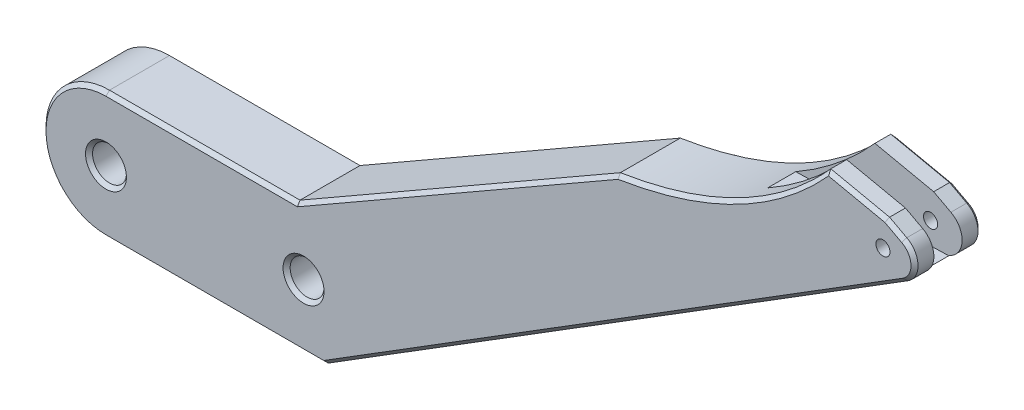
ISO-10303-21;
HEADER;
FILE_DESCRIPTION(('STEP AP214'),'2;1');
FILE_NAME('part.step','',(''),(''),'','','');
FILE_SCHEMA(('AUTOMOTIVE_DESIGN { 1 0 10303 214 1 1 1 1 }'));
ENDSEC;
DATA;
#1=APPLICATION_CONTEXT('core data for automotive mechanical design processes');
#2=APPLICATION_PROTOCOL_DEFINITION('international standard','automotive_design',2000,#1);
#3=PRODUCT_CONTEXT('',#1,'mechanical');
#4=PRODUCT('Part','Part','',(#3));
#5=PRODUCT_RELATED_PRODUCT_CATEGORY('part','',(#4));
#6=PRODUCT_DEFINITION_FORMATION('','',#4);
#7=PRODUCT_DEFINITION_CONTEXT('part definition',#1,'design');
#8=PRODUCT_DEFINITION('design','',#6,#7);
#9=PRODUCT_DEFINITION_SHAPE('','',#8);
#10=(LENGTH_UNIT() NAMED_UNIT(*) SI_UNIT(.MILLI.,.METRE.));
#11=(NAMED_UNIT(*) PLANE_ANGLE_UNIT() SI_UNIT($,.RADIAN.));
#12=(NAMED_UNIT(*) SI_UNIT($,.STERADIAN.) SOLID_ANGLE_UNIT());
#13=UNCERTAINTY_MEASURE_WITH_UNIT(LENGTH_MEASURE(1.E-05),#10,'distance_accuracy_value','');
#14=(GEOMETRIC_REPRESENTATION_CONTEXT(3) GLOBAL_UNCERTAINTY_ASSIGNED_CONTEXT((#13)) GLOBAL_UNIT_ASSIGNED_CONTEXT((#10,
#11,#12)) REPRESENTATION_CONTEXT('',''));
#15=CARTESIAN_POINT('',(0.,0.,0.));
#16=DIRECTION('',(0.,0.,1.));
#17=DIRECTION('',(1.,0.,0.));
#18=AXIS2_PLACEMENT_3D('',#15,#16,#17);
#19=CARTESIAN_POINT('',(122.77063431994,71.2899516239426,4.75));
#20=DIRECTION('',(-0.469698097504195,-0.882827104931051,0.));
#21=DIRECTION('',(0.882827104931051,-0.469698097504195,0.));
#22=AXIS2_PLACEMENT_3D('',#19,#20,#21);
#23=PLANE('',#22);
#24=DIRECTION('',(0.,0.,1.));
#25=VECTOR('',#24,1.);
#26=CARTESIAN_POINT('',(129.547375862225,67.6844635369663,4.75));
#27=LINE('',#26,#25);
#28=CARTESIAN_POINT('',(129.547375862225,67.6844635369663,2.));
#29=VERTEX_POINT('',#28);
#30=CARTESIAN_POINT('',(129.547375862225,67.6844635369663,4.25));
#31=VERTEX_POINT('',#30);
#32=EDGE_CURVE('E228',#29,#31,#27,.T.);
#33=ORIENTED_EDGE('',*,*,#32,.T.);
#34=DIRECTION('',(0.882827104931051,-0.469698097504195,0.));
#35=VECTOR('',#34,1.);
#36=CARTESIAN_POINT('',(122.77063431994,71.2899516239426,4.24999999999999));
#37=LINE('',#36,#35);
#38=CARTESIAN_POINT('',(131.988780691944,66.3855419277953,4.24999999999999));
#39=VERTEX_POINT('',#38);
#40=EDGE_CURVE('E758',#31,#39,#37,.T.);
#41=ORIENTED_EDGE('',*,*,#40,.T.);
#42=DIRECTION('',(0.,0.,-1.));
#43=VECTOR('',#42,1.);
#44=CARTESIAN_POINT('',(131.988780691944,66.3855419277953,4.75));
#45=LINE('',#44,#43);
#46=CARTESIAN_POINT('',(131.988780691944,66.3855419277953,2.));
#47=VERTEX_POINT('',#46);
#48=EDGE_CURVE('E471',#39,#47,#45,.T.);
#49=ORIENTED_EDGE('',*,*,#48,.T.);
#50=DIRECTION('',(0.882827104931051,-0.469698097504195,0.));
#51=VECTOR('',#50,1.);
#52=CARTESIAN_POINT('',(122.77063431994,71.2899516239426,2.));
#53=LINE('',#52,#51);
#54=EDGE_CURVE('E245',#29,#47,#53,.T.);
#55=ORIENTED_EDGE('',*,*,#54,.F.);
#56=EDGE_LOOP('',(#33,#41,#49,#55));
#57=FACE_BOUND('',#56,.T.);
#58=ADVANCED_FACE('F38',(#57),#23,.F.);
#59=CARTESIAN_POINT('',(129.106457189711,63.9418806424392,4.75));
#60=DIRECTION('',(0.,0.,-1.));
#61=DIRECTION('',(-1.,0.,0.));
#62=AXIS2_PLACEMENT_3D('',#59,#60,#61);
#63=CYLINDRICAL_SURFACE('',#62,0.999999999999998);
#64=CARTESIAN_POINT('',(129.106457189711,63.9418806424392,4.75));
#65=DIRECTION('',(0.,0.,1.));
#66=DIRECTION('',(1.,0.,0.));
#67=AXIS2_PLACEMENT_3D('',#64,#65,#66);
#68=CIRCLE('',#67,0.999999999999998);
#69=CARTESIAN_POINT('',(130.106457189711,63.9418806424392,4.75));
#70=VERTEX_POINT('',#69);
#71=EDGE_CURVE('E280',#70,#70,#68,.T.);
#72=ORIENTED_EDGE('',*,*,#71,.T.);
#73=EDGE_LOOP('',(#72));
#74=FACE_BOUND('',#73,.T.);
#75=CARTESIAN_POINT('',(129.106457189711,63.9418806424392,2.));
#76=DIRECTION('',(0.,0.,-1.));
#77=DIRECTION('',(-1.,0.,0.));
#78=AXIS2_PLACEMENT_3D('',#75,#76,#77);
#79=CIRCLE('',#78,0.999999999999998);
#80=CARTESIAN_POINT('',(128.106457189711,63.9418806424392,2.));
#81=VERTEX_POINT('',#80);
#82=EDGE_CURVE('E246',#81,#81,#79,.T.);
#83=ORIENTED_EDGE('',*,*,#82,.T.);
#84=EDGE_LOOP('',(#83));
#85=FACE_BOUND('',#84,.T.);
#86=ADVANCED_FACE('F361',(#74,#85),#63,.F.);
#87=CARTESIAN_POINT('',(109.281053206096,59.967101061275,4.75));
#88=DIRECTION('',(0.,0.,-1.));
#89=DIRECTION('',(-1.,0.,0.));
#90=AXIS2_PLACEMENT_3D('',#87,#88,#89);
#91=PLANE('',#90);
#92=CARTESIAN_POINT('',(47.,19.,4.75));
#93=DIRECTION('',(0.,0.,-1.));
#94=DIRECTION('',(-1.,0.,0.));
#95=AXIS2_PLACEMENT_3D('',#92,#93,#94);
#96=CIRCLE('',#95,2.90000000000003);
#97=CARTESIAN_POINT('',(44.1,19.,4.75));
#98=VERTEX_POINT('',#97);
#99=EDGE_CURVE('E755',#98,#98,#96,.T.);
#100=ORIENTED_EDGE('',*,*,#99,.T.);
#101=EDGE_LOOP('',(#100));
#102=FACE_BOUND('',#101,.T.);
#103=CARTESIAN_POINT('',(19.,19.,4.75));
#104=DIRECTION('',(0.,0.,-1.));
#105=DIRECTION('',(-1.,0.,0.));
#106=AXIS2_PLACEMENT_3D('',#103,#104,#105);
#107=CIRCLE('',#106,2.89999999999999);
#108=CARTESIAN_POINT('',(16.1,19.,4.75));
#109=VERTEX_POINT('',#108);
#110=EDGE_CURVE('E752',#109,#109,#107,.T.);
#111=ORIENTED_EDGE('',*,*,#110,.T.);
#112=EDGE_LOOP('',(#111));
#113=FACE_BOUND('',#112,.T.);
#114=CARTESIAN_POINT('',(130.579686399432,63.7370606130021,4.75));
#115=DIRECTION('',(0.,0.,-1.));
#116=DIRECTION('',(-1.,0.,0.));
#117=AXIS2_PLACEMENT_3D('',#114,#115,#116);
#118=CIRCLE('',#117,2.49999999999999);
#119=CARTESIAN_POINT('',(131.901655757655,61.6151753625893,4.75));
#120=VERTEX_POINT('',#119);
#121=CARTESIAN_POINT('',(131.753931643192,65.9441283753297,4.75));
#122=VERTEX_POINT('',#121);
#123=EDGE_CURVE('E743',#120,#122,#118,.F.);
#124=ORIENTED_EDGE('',*,*,#123,.T.);
#125=DIRECTION('',(-0.882827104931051,0.469698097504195,0.));
#126=VECTOR('',#125,1.);
#127=CARTESIAN_POINT('',(116.717383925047,73.9441521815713,4.75));
#128=LINE('',#127,#126);
#129=CARTESIAN_POINT('',(129.374485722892,67.2100854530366,4.75));
#130=VERTEX_POINT('',#129);
#131=EDGE_CURVE('E749',#122,#130,#128,.T.);
#132=ORIENTED_EDGE('',*,*,#131,.T.);
#133=DIRECTION('',(-0.978022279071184,0.208500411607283,0.));
#134=VECTOR('',#133,1.);
#135=CARTESIAN_POINT('',(111.631538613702,70.9926289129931,4.75));
#136=LINE('',#135,#134);
#137=CARTESIAN_POINT('',(121.398316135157,68.9104911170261,4.75));
#138=VERTEX_POINT('',#137);
#139=EDGE_CURVE('E657',#130,#138,#136,.T.);
#140=ORIENTED_EDGE('',*,*,#139,.T.);
#141=CARTESIAN_POINT('',(89.7670489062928,53.3053007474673,4.75));
#142=CARTESIAN_POINT('',(89.9629582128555,53.336365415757,4.75));
#143=CARTESIAN_POINT('',(90.1588675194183,53.3674300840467,4.75));
#144=CARTESIAN_POINT('',(90.4527314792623,53.4140270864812,4.75));
#145=CARTESIAN_POINT('',(90.5506861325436,53.4295594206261,4.75));
#146=CARTESIAN_POINT('',(90.7465954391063,53.4606240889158,4.75));
#147=CARTESIAN_POINT('',(90.8445500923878,53.4761564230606,4.75));
#148=CARTESIAN_POINT('',(90.9914820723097,53.4994549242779,4.75));
#149=CARTESIAN_POINT('',(91.0404593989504,53.5072210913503,4.75));
#150=CARTESIAN_POINT('',(91.1384140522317,53.5227534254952,4.75));
#151=CARTESIAN_POINT('',(91.1873913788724,53.5305195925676,4.75));
#152=CARTESIAN_POINT('',(91.2853460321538,53.5460519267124,4.75));
#153=CARTESIAN_POINT('',(91.3343237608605,53.5538161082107,4.75));
#154=CARTESIAN_POINT('',(91.4077891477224,53.5654683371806,4.75));
#155=CARTESIAN_POINT('',(91.4322778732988,53.5693511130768,4.75));
#156=CARTESIAN_POINT('',(91.4812554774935,53.577115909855,4.75));
#157=CARTESIAN_POINT('',(91.5057437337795,53.5810010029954,4.75));
#158=CARTESIAN_POINT('',(91.5791978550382,53.592708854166,4.75));
#159=CARTESIAN_POINT('',(91.6281569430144,53.6005650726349,4.75));
#160=CARTESIAN_POINT('',(91.7260533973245,53.6163847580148,4.75));
#161=CARTESIAN_POINT('',(91.7749909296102,53.6243474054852,4.75));
#162=CARTESIAN_POINT('',(91.9217713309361,53.6483943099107,4.75));
#163=CARTESIAN_POINT('',(92.0195820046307,53.6646375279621,4.75));
#164=CARTESIAN_POINT('',(92.3128843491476,53.7140074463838,4.75));
#165=CARTESIAN_POINT('',(92.5082463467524,53.7477743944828,4.75));
#166=CARTESIAN_POINT('',(92.8986196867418,53.8170396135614,4.75));
#167=CARTESIAN_POINT('',(93.0936310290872,53.8525378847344,4.75));
#168=CARTESIAN_POINT('',(93.6781316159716,53.9616665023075,4.75));
#169=CARTESIAN_POINT('',(94.0670874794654,54.0379303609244,4.75));
#170=CARTESIAN_POINT('',(95.2317596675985,54.2775615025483,4.75));
#171=CARTESIAN_POINT('',(96.0053000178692,54.4517681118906,4.75));
#172=CARTESIAN_POINT('',(97.1609004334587,54.7360466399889,4.75));
#173=CARTESIAN_POINT('',(97.5453581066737,54.8346477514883,4.75));
#174=CARTESIAN_POINT('',(98.12078491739,54.9884570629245,4.75));
#175=CARTESIAN_POINT('',(98.312418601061,55.0407215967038,4.75));
#176=CARTESIAN_POINT('',(98.695226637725,55.1472409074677,4.75));
#177=CARTESIAN_POINT('',(98.8864849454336,55.201520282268,4.75));
#178=CARTESIAN_POINT('',(99.4591046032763,55.3672577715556,4.75));
#179=CARTESIAN_POINT('',(99.8392740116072,55.4815987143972,4.75));
#180=CARTESIAN_POINT('',(100.596576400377,55.718193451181,4.75));
#181=CARTESIAN_POINT('',(100.973679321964,55.8404381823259,4.75));
#182=CARTESIAN_POINT('',(102.1002458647,56.2192627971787,4.75));
#183=CARTESIAN_POINT('',(102.844968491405,56.4879299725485,4.75));
#184=CARTESIAN_POINT('',(104.321222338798,57.0588961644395,4.75));
#185=CARTESIAN_POINT('',(105.052753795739,57.3611945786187,4.75));
#186=CARTESIAN_POINT('',(106.139715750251,57.8409921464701,4.75));
#187=CARTESIAN_POINT('',(106.50031357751,58.0053170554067,4.75));
#188=CARTESIAN_POINT('',(107.217985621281,58.3429504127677,4.75));
#189=CARTESIAN_POINT('',(107.575093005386,58.5162774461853,4.75));
#190=CARTESIAN_POINT('',(108.285570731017,58.8720466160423,4.75));
#191=CARTESIAN_POINT('',(108.639332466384,59.0547067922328,4.75));
#192=CARTESIAN_POINT('',(109.34061907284,59.4280497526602,4.75));
#193=CARTESIAN_POINT('',(109.688579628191,59.6189424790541,4.75));
#194=CARTESIAN_POINT('',(110.378857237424,60.0091183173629,4.75));
#195=CARTESIAN_POINT('',(110.721213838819,60.2084203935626,4.75));
#196=CARTESIAN_POINT('',(111.400321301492,60.6155154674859,4.75));
#197=CARTESIAN_POINT('',(111.737072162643,60.8233084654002,4.75));
#198=CARTESIAN_POINT('',(112.738853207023,61.4595191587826,4.75));
#199=CARTESIAN_POINT('',(113.395412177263,61.9007680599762,4.75));
#200=CARTESIAN_POINT('',(114.363050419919,62.5886942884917,4.75));
#201=CARTESIAN_POINT('',(114.682729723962,62.8223452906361,4.75));
#202=CARTESIAN_POINT('',(115.31631081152,63.2983984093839,4.75));
#203=CARTESIAN_POINT('',(115.63021259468,63.5408005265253,4.75));
#204=CARTESIAN_POINT('',(116.096698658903,63.9110177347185,4.75));
#205=CARTESIAN_POINT('',(116.251478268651,64.0355359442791,4.75));
#206=CARTESIAN_POINT('',(116.55952815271,64.2867451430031,4.75));
#207=CARTESIAN_POINT('',(116.712913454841,64.4135329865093,4.75));
#208=CARTESIAN_POINT('',(117.017774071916,64.6689578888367,4.75));
#209=CARTESIAN_POINT('',(117.169245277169,64.7975884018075,4.75));
#210=CARTESIAN_POINT('',(117.470309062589,65.0567041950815,4.75));
#211=CARTESIAN_POINT('',(117.619896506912,65.1871849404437,4.75));
#212=CARTESIAN_POINT('',(118.065838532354,65.5813829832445,4.75));
#213=CARTESIAN_POINT('',(118.359372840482,65.8478560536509,4.75));
#214=CARTESIAN_POINT('',(118.938989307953,66.3880839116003,4.75));
#215=CARTESIAN_POINT('',(119.225071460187,66.6618387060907,4.75));
#216=CARTESIAN_POINT('',(120.072240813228,67.4939268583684,4.74999999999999));
#217=CARTESIAN_POINT('',(120.622251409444,68.0630834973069,4.75));
#218=CARTESIAN_POINT('',(121.693260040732,69.2297458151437,4.75));
#219=CARTESIAN_POINT('',(122.214257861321,69.8272517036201,4.75));
#220=CARTESIAN_POINT('',(122.721003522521,70.4386838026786,4.75));
#221=B_SPLINE_CURVE_WITH_KNOTS('',3,(#141,#142,#143,#144,#145,#146,#147,#148,#149,#150,#151,
#152,#153,#154,#155,#156,#157,#158,#159,#160,#161,#162,#163,#164,#165,#166,#167,#168,#169,#170,
#171,#172,#173,#174,#175,#176,#177,#178,#179,#180,#181,#182,#183,#184,#185,#186,#187,#188,#189,
#190,#191,#192,#193,#194,#195,#196,#197,#198,#199,#200,#201,#202,#203,#204,#205,#206,#207,#208,
#209,#210,#211,#212,#213,#214,#215,#216,#217,#218,#219,#220),.UNSPECIFIED.,.F.,.F.,(4,2,2,2,2,2,
2,2,2,2,2,2,2,2,2,2,2,2,2,2,2,2,2,2,2,2,2,2,2,2,2,2,2,2,2,2,2,2,2,4),(0.000955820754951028,
0.00154942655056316,0.00184622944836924,0.00214303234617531,0.00229143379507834,
0.00243983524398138,0.00258823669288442,0.00266243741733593,0.00273663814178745,
0.00288503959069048,0.00303344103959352,0.00333024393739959,0.00392384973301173,
0.00451745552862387,0.00570466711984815,0.00807909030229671,0.00926630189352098,
0.00985990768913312,0.0104535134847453,0.0116407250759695,0.0128279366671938,0.0152023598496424,
0.0175767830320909,0.0187639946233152,0.0199512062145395,0.0211384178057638,0.0223256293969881,
0.0235128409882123,0.0247000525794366,0.0270744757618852,0.0282616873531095,0.0294488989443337,
0.0300425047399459,0.030636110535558,0.0312297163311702,0.0318233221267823,0.0330105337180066,
0.0341977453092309,0.0365721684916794,0.038946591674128),.UNSPECIFIED.);
#222=CARTESIAN_POINT('',(91.5678402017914,53.5909086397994,4.75));
#223=VERTEX_POINT('',#222);
#224=EDGE_CURVE('E343',#138,#223,#221,.F.);
#225=ORIENTED_EDGE('',*,*,#224,.T.);
#226=DIRECTION('',(-0.867185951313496,-0.497984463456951,0.));
#227=VECTOR('',#226,1.);
#228=CARTESIAN_POINT('',(107.641907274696,62.8214959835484,4.75));
#229=LINE('',#228,#227);
#230=CARTESIAN_POINT('',(46.1333515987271,27.5,4.75));
#231=VERTEX_POINT('',#230);
#232=EDGE_CURVE('E339',#223,#231,#229,.T.);
#233=ORIENTED_EDGE('',*,*,#232,.T.);
#234=DIRECTION('',(-1.,0.,0.));
#235=VECTOR('',#234,1.);
#236=CARTESIAN_POINT('',(109.281053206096,27.5,4.75));
#237=LINE('',#236,#235);
#238=CARTESIAN_POINT('',(19.,27.5,4.75));
#239=VERTEX_POINT('',#238);
#240=EDGE_CURVE('E337',#231,#239,#237,.T.);
#241=ORIENTED_EDGE('',*,*,#240,.T.);
#242=CARTESIAN_POINT('',(19.,19.,4.75));
#243=DIRECTION('',(0.,0.,-1.));
#244=DIRECTION('',(-1.,0.,0.));
#245=AXIS2_PLACEMENT_3D('',#242,#243,#244);
#246=CIRCLE('',#245,8.5);
#247=CARTESIAN_POINT('',(10.5,19.,4.75));
#248=VERTEX_POINT('',#247);
#249=EDGE_CURVE('E658',#239,#248,#246,.F.);
#250=ORIENTED_EDGE('',*,*,#249,.T.);
#251=CARTESIAN_POINT('',(19.,19.,4.75));
#252=DIRECTION('',(0.,0.,-1.));
#253=DIRECTION('',(-1.,0.,0.));
#254=AXIS2_PLACEMENT_3D('',#251,#252,#253);
#255=CIRCLE('',#254,8.5);
#256=CARTESIAN_POINT('',(19.,10.5,4.75));
#257=VERTEX_POINT('',#256);
#258=EDGE_CURVE('E741',#248,#257,#255,.F.);
#259=ORIENTED_EDGE('',*,*,#258,.T.);
#260=DIRECTION('',(1.,0.,0.));
#261=VECTOR('',#260,1.);
#262=CARTESIAN_POINT('',(109.281053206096,10.5,4.75));
#263=LINE('',#262,#261);
#264=CARTESIAN_POINT('',(49.8569880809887,10.5,4.75));
#265=VERTEX_POINT('',#264);
#266=EDGE_CURVE('E738',#257,#265,#263,.T.);
#267=ORIENTED_EDGE('',*,*,#266,.T.);
#268=DIRECTION('',(0.848754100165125,0.528787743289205,0.));
#269=VECTOR('',#268,1.);
#270=CARTESIAN_POINT('',(114.866472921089,51.0019766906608,4.75));
#271=LINE('',#270,#269);
#272=EDGE_CURVE('E740',#265,#120,#271,.T.);
#273=ORIENTED_EDGE('',*,*,#272,.T.);
#274=EDGE_LOOP('',(#124,#132,#140,#225,#233,#241,#250,#259,#267,#273));
#275=FACE_BOUND('',#274,.T.);
#276=ORIENTED_EDGE('',*,*,#71,.F.);
#277=EDGE_LOOP('',(#276));
#278=FACE_BOUND('',#277,.T.);
#279=ADVANCED_FACE('F350',(#102,#113,#275,#278),#91,.F.);
#280=CARTESIAN_POINT('',(109.281053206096,59.967101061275,-4.75));
#281=DIRECTION('',(0.,0.,-1.));
#282=DIRECTION('',(-1.,0.,0.));
#283=AXIS2_PLACEMENT_3D('',#280,#281,#282);
#284=PLANE('',#283);
#285=CARTESIAN_POINT('',(47.,19.,-4.75));
#286=DIRECTION('',(0.,0.,-1.));
#287=DIRECTION('',(-1.,0.,0.));
#288=AXIS2_PLACEMENT_3D('',#285,#286,#287);
#289=CIRCLE('',#288,2.89999999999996);
#290=CARTESIAN_POINT('',(44.1,19.,-4.75));
#291=VERTEX_POINT('',#290);
#292=EDGE_CURVE('E404',#291,#291,#289,.F.);
#293=ORIENTED_EDGE('',*,*,#292,.T.);
#294=EDGE_LOOP('',(#293));
#295=FACE_BOUND('',#294,.T.);
#296=DIRECTION('',(0.978022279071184,-0.208500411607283,0.));
#297=VECTOR('',#296,1.);
#298=CARTESIAN_POINT('',(129.443125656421,67.1954523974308,-4.75));
#299=LINE('',#298,#297);
#300=CARTESIAN_POINT('',(121.398316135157,68.9104911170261,-4.75));
#301=VERTEX_POINT('',#300);
#302=CARTESIAN_POINT('',(129.374485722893,67.2100854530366,-4.75));
#303=VERTEX_POINT('',#302);
#304=EDGE_CURVE('E387',#301,#303,#299,.T.);
#305=ORIENTED_EDGE('',*,*,#304,.T.);
#306=DIRECTION('',(0.882827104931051,-0.469698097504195,0.));
#307=VECTOR('',#306,1.);
#308=CARTESIAN_POINT('',(131.753931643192,65.9441283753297,-4.75));
#309=LINE('',#308,#307);
#310=CARTESIAN_POINT('',(131.753931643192,65.9441283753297,-4.75));
#311=VERTEX_POINT('',#310);
#312=EDGE_CURVE('E401',#303,#311,#309,.T.);
#313=ORIENTED_EDGE('',*,*,#312,.T.);
#314=CARTESIAN_POINT('',(130.579686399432,63.7370606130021,-4.75));
#315=DIRECTION('',(0.,0.,-1.));
#316=DIRECTION('',(-1.,0.,0.));
#317=AXIS2_PLACEMENT_3D('',#314,#315,#316);
#318=CIRCLE('',#317,2.49999999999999);
#319=CARTESIAN_POINT('',(131.901655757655,61.6151753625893,-4.75));
#320=VERTEX_POINT('',#319);
#321=EDGE_CURVE('E399',#311,#320,#318,.T.);
#322=ORIENTED_EDGE('',*,*,#321,.T.);
#323=DIRECTION('',(-0.848754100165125,-0.528787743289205,0.));
#324=VECTOR('',#323,1.);
#325=CARTESIAN_POINT('',(49.7356061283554,10.4243770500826,-4.75));
#326=LINE('',#325,#324);
#327=CARTESIAN_POINT('',(49.8569880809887,10.5,-4.75));
#328=VERTEX_POINT('',#327);
#329=EDGE_CURVE('E397',#320,#328,#326,.T.);
#330=ORIENTED_EDGE('',*,*,#329,.T.);
#331=DIRECTION('',(-1.,0.,0.));
#332=VECTOR('',#331,1.);
#333=CARTESIAN_POINT('',(19.,10.5,-4.75));
#334=LINE('',#333,#332);
#335=CARTESIAN_POINT('',(19.,10.5,-4.75));
#336=VERTEX_POINT('',#335);
#337=EDGE_CURVE('E395',#328,#336,#334,.T.);
#338=ORIENTED_EDGE('',*,*,#337,.T.);
#339=CARTESIAN_POINT('',(19.,19.,-4.75));
#340=DIRECTION('',(0.,0.,-1.));
#341=DIRECTION('',(-1.,0.,0.));
#342=AXIS2_PLACEMENT_3D('',#339,#340,#341);
#343=CIRCLE('',#342,8.5);
#344=CARTESIAN_POINT('',(10.5,19.,-4.75));
#345=VERTEX_POINT('',#344);
#346=EDGE_CURVE('E393',#336,#345,#343,.T.);
#347=ORIENTED_EDGE('',*,*,#346,.T.);
#348=CARTESIAN_POINT('',(19.,19.,-4.75));
#349=DIRECTION('',(0.,0.,-1.));
#350=DIRECTION('',(-1.,0.,0.));
#351=AXIS2_PLACEMENT_3D('',#348,#349,#350);
#352=CIRCLE('',#351,8.5);
#353=CARTESIAN_POINT('',(19.,27.5,-4.75));
#354=VERTEX_POINT('',#353);
#355=EDGE_CURVE('E389',#345,#354,#352,.T.);
#356=ORIENTED_EDGE('',*,*,#355,.T.);
#357=DIRECTION('',(1.,0.,0.));
#358=VECTOR('',#357,1.);
#359=CARTESIAN_POINT('',(46.,27.5,-4.75));
#360=LINE('',#359,#358);
#361=CARTESIAN_POINT('',(46.1333515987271,27.5,-4.75));
#362=VERTEX_POINT('',#361);
#363=EDGE_CURVE('E384',#354,#362,#360,.T.);
#364=ORIENTED_EDGE('',*,*,#363,.T.);
#365=DIRECTION('',(0.867185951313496,0.497984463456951,0.));
#366=VECTOR('',#365,1.);
#367=CARTESIAN_POINT('',(91.6474901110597,53.6366478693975,-4.75));
#368=LINE('',#367,#366);
#369=CARTESIAN_POINT('',(91.5678402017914,53.5909086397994,-4.75));
#370=VERTEX_POINT('',#369);
#371=EDGE_CURVE('E376',#362,#370,#368,.T.);
#372=ORIENTED_EDGE('',*,*,#371,.T.);
#373=CARTESIAN_POINT('',(122.721003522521,70.4386838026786,-4.75));
#374=CARTESIAN_POINT('',(122.214257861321,69.8272517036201,-4.75));
#375=CARTESIAN_POINT('',(121.693260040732,69.2297458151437,-4.75));
#376=CARTESIAN_POINT('',(120.622251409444,68.0630834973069,-4.75));
#377=CARTESIAN_POINT('',(120.072240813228,67.4939268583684,-4.75000000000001));
#378=CARTESIAN_POINT('',(119.225071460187,66.6618387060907,-4.75));
#379=CARTESIAN_POINT('',(118.938989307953,66.3880839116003,-4.75));
#380=CARTESIAN_POINT('',(118.359372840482,65.8478560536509,-4.75));
#381=CARTESIAN_POINT('',(118.065838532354,65.5813829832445,-4.74999999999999));
#382=CARTESIAN_POINT('',(117.619896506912,65.1871849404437,-4.75));
#383=CARTESIAN_POINT('',(117.470309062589,65.0567041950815,-4.75));
#384=CARTESIAN_POINT('',(117.169245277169,64.7975884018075,-4.75));
#385=CARTESIAN_POINT('',(117.017774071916,64.6689578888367,-4.75));
#386=CARTESIAN_POINT('',(116.712913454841,64.4135329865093,-4.75));
#387=CARTESIAN_POINT('',(116.55952815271,64.2867451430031,-4.75));
#388=CARTESIAN_POINT('',(116.251478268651,64.0355359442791,-4.75));
#389=CARTESIAN_POINT('',(116.096698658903,63.9110177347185,-4.75));
#390=CARTESIAN_POINT('',(115.63021259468,63.5408005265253,-4.75));
#391=CARTESIAN_POINT('',(115.31631081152,63.2983984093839,-4.75));
#392=CARTESIAN_POINT('',(114.682729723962,62.8223452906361,-4.75));
#393=CARTESIAN_POINT('',(114.363050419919,62.5886942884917,-4.75));
#394=CARTESIAN_POINT('',(113.395412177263,61.9007680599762,-4.75));
#395=CARTESIAN_POINT('',(112.738853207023,61.4595191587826,-4.75000000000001));
#396=CARTESIAN_POINT('',(111.737072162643,60.8233084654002,-4.75));
#397=CARTESIAN_POINT('',(111.400321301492,60.6155154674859,-4.75000000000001));
#398=CARTESIAN_POINT('',(110.721213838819,60.2084203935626,-4.75));
#399=CARTESIAN_POINT('',(110.378857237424,60.0091183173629,-4.75));
#400=CARTESIAN_POINT('',(109.688579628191,59.6189424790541,-4.75));
#401=CARTESIAN_POINT('',(109.34061907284,59.4280497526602,-4.75));
#402=CARTESIAN_POINT('',(108.639332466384,59.0547067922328,-4.75));
#403=CARTESIAN_POINT('',(108.285570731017,58.8720466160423,-4.75));
#404=CARTESIAN_POINT('',(107.575093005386,58.5162774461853,-4.75));
#405=CARTESIAN_POINT('',(107.217985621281,58.3429504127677,-4.75));
#406=CARTESIAN_POINT('',(106.50031357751,58.0053170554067,-4.75));
#407=CARTESIAN_POINT('',(106.139715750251,57.8409921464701,-4.75));
#408=CARTESIAN_POINT('',(105.052753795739,57.3611945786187,-4.75));
#409=CARTESIAN_POINT('',(104.321222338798,57.0588961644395,-4.75));
#410=CARTESIAN_POINT('',(102.844968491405,56.4879299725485,-4.75));
#411=CARTESIAN_POINT('',(102.1002458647,56.2192627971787,-4.75));
#412=CARTESIAN_POINT('',(100.973679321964,55.8404381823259,-4.75));
#413=CARTESIAN_POINT('',(100.596576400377,55.718193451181,-4.75));
#414=CARTESIAN_POINT('',(99.8392740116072,55.4815987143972,-4.75));
#415=CARTESIAN_POINT('',(99.4591046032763,55.3672577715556,-4.75));
#416=CARTESIAN_POINT('',(98.8864849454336,55.201520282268,-4.75));
#417=CARTESIAN_POINT('',(98.695226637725,55.1472409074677,-4.75));
#418=CARTESIAN_POINT('',(98.312418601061,55.0407215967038,-4.75));
#419=CARTESIAN_POINT('',(98.12078491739,54.9884570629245,-4.75));
#420=CARTESIAN_POINT('',(97.5453581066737,54.8346477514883,-4.75));
#421=CARTESIAN_POINT('',(97.1609004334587,54.7360466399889,-4.75));
#422=CARTESIAN_POINT('',(96.0053000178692,54.4517681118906,-4.75));
#423=CARTESIAN_POINT('',(95.2317596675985,54.2775615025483,-4.75));
#424=CARTESIAN_POINT('',(94.0670874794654,54.0379303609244,-4.75));
#425=CARTESIAN_POINT('',(93.6781316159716,53.9616665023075,-4.75));
#426=CARTESIAN_POINT('',(93.0936310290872,53.8525378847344,-4.75));
#427=CARTESIAN_POINT('',(92.8986196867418,53.8170396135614,-4.75));
#428=CARTESIAN_POINT('',(92.5082463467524,53.7477743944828,-4.75));
#429=CARTESIAN_POINT('',(92.3128843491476,53.7140074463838,-4.75));
#430=CARTESIAN_POINT('',(92.0195820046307,53.6646375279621,-4.75));
#431=CARTESIAN_POINT('',(91.9217713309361,53.6483943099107,-4.75));
#432=CARTESIAN_POINT('',(91.7749909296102,53.6243474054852,-4.75));
#433=CARTESIAN_POINT('',(91.7260533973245,53.6163847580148,-4.75));
#434=CARTESIAN_POINT('',(91.6281569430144,53.6005650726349,-4.75));
#435=CARTESIAN_POINT('',(91.5791978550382,53.592708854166,-4.75));
#436=CARTESIAN_POINT('',(91.5057437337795,53.5810010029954,-4.75));
#437=CARTESIAN_POINT('',(91.4812554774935,53.577115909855,-4.75));
#438=CARTESIAN_POINT('',(91.4322778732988,53.5693511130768,-4.75));
#439=CARTESIAN_POINT('',(91.4077891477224,53.5654683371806,-4.75));
#440=CARTESIAN_POINT('',(91.3343237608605,53.5538161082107,-4.75));
#441=CARTESIAN_POINT('',(91.2853460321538,53.5460519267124,-4.75));
#442=CARTESIAN_POINT('',(91.1873913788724,53.5305195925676,-4.75));
#443=CARTESIAN_POINT('',(91.1384140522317,53.5227534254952,-4.75));
#444=CARTESIAN_POINT('',(91.0404593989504,53.5072210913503,-4.75));
#445=CARTESIAN_POINT('',(90.9914820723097,53.4994549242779,-4.75));
#446=CARTESIAN_POINT('',(90.8445500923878,53.4761564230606,-4.75));
#447=CARTESIAN_POINT('',(90.7465954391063,53.4606240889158,-4.75));
#448=CARTESIAN_POINT('',(90.5506861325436,53.4295594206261,-4.75));
#449=CARTESIAN_POINT('',(90.4527314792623,53.4140270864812,-4.75));
#450=CARTESIAN_POINT('',(90.1588675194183,53.3674300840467,-4.75));
#451=CARTESIAN_POINT('',(89.9629582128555,53.336365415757,-4.75));
#452=CARTESIAN_POINT('',(89.7670489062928,53.3053007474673,-4.75));
#453=B_SPLINE_CURVE_WITH_KNOTS('',3,(#373,#374,#375,#376,#377,#378,#379,#380,#381,#382,#383,
#384,#385,#386,#387,#388,#389,#390,#391,#392,#393,#394,#395,#396,#397,#398,#399,#400,#401,#402,
#403,#404,#405,#406,#407,#408,#409,#410,#411,#412,#413,#414,#415,#416,#417,#418,#419,#420,#421,
#422,#423,#424,#425,#426,#427,#428,#429,#430,#431,#432,#433,#434,#435,#436,#437,#438,#439,#440,
#441,#442,#443,#444,#445,#446,#447,#448,#449,#450,#451,#452),.UNSPECIFIED.,.F.,.F.,(4,2,2,2,2,2,
2,2,2,2,2,2,2,2,2,2,2,2,2,2,2,2,2,2,2,2,2,2,2,2,2,2,2,2,2,2,2,2,2,4),(0.000955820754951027,
0.00333024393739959,0.00570466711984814,0.00689187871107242,0.0080790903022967,
0.00867269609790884,0.00926630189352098,0.00985990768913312,0.0104535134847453,
0.0116407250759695,0.0128279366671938,0.0152023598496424,0.0163895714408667,0.0175767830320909,
0.0187639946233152,0.0199512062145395,0.0211384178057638,0.0223256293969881,0.0247000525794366,
0.0270744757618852,0.0282616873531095,0.0294488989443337,0.0300425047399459,0.030636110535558,
0.0318233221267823,0.0341977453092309,0.0353849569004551,0.0359785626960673,0.0365721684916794,
0.0368689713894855,0.0370173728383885,0.0371657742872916,0.0372399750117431,0.0373141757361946,
0.0374625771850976,0.0376109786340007,0.0377593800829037,0.0380561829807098,0.0383529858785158,
0.038946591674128),.UNSPECIFIED.);
#454=EDGE_CURVE('E383',#370,#301,#453,.F.);
#455=ORIENTED_EDGE('',*,*,#454,.T.);
#456=EDGE_LOOP('',(#305,#313,#322,#330,#338,#347,#356,#364,#372,#455));
#457=FACE_BOUND('',#456,.T.);
#458=CARTESIAN_POINT('',(19.,19.,-4.75));
#459=DIRECTION('',(0.,0.,-1.));
#460=DIRECTION('',(-1.,0.,0.));
#461=AXIS2_PLACEMENT_3D('',#458,#459,#460);
#462=CIRCLE('',#461,2.90000000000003);
#463=CARTESIAN_POINT('',(16.1,19.,-4.75));
#464=VERTEX_POINT('',#463);
#465=EDGE_CURVE('E478',#464,#464,#462,.F.);
#466=ORIENTED_EDGE('',*,*,#465,.T.);
#467=EDGE_LOOP('',(#466));
#468=FACE_BOUND('',#467,.T.);
#469=CARTESIAN_POINT('',(129.106457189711,63.9418806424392,-4.75));
#470=DIRECTION('',(0.,0.,1.));
#471=DIRECTION('',(1.,0.,0.));
#472=AXIS2_PLACEMENT_3D('',#469,#470,#471);
#473=CIRCLE('',#472,0.999999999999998);
#474=CARTESIAN_POINT('',(130.106457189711,63.9418806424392,-4.75));
#475=VERTEX_POINT('',#474);
#476=EDGE_CURVE('E284',#475,#475,#473,.T.);
#477=ORIENTED_EDGE('',*,*,#476,.T.);
#478=EDGE_LOOP('',(#477));
#479=FACE_BOUND('',#478,.T.);
#480=ADVANCED_FACE('F360',(#295,#457,#468,#479),#284,.T.);
#481=CARTESIAN_POINT('',(10.,10.,4.75));
#482=DIRECTION('',(0.,1.,0.));
#483=DIRECTION('',(0.,0.,1.));
#484=AXIS2_PLACEMENT_3D('',#481,#482,#483);
#485=PLANE('',#484);
#486=DIRECTION('',(0.,0.,-1.));
#487=VECTOR('',#486,1.);
#488=CARTESIAN_POINT('',(19.,10.,4.75));
#489=LINE('',#488,#487);
#490=CARTESIAN_POINT('',(19.,10.,4.25));
#491=VERTEX_POINT('',#490);
#492=CARTESIAN_POINT('',(19.,10.,-4.25));
#493=VERTEX_POINT('',#492);
#494=EDGE_CURVE('E451',#491,#493,#489,.T.);
#495=ORIENTED_EDGE('',*,*,#494,.T.);
#496=DIRECTION('',(1.,0.,0.));
#497=VECTOR('',#496,1.);
#498=CARTESIAN_POINT('',(50.,10.,-4.25));
#499=LINE('',#498,#497);
#500=CARTESIAN_POINT('',(50.,10.,-4.25));
#501=VERTEX_POINT('',#500);
#502=EDGE_CURVE('E421',#493,#501,#499,.T.);
#503=ORIENTED_EDGE('',*,*,#502,.T.);
#504=DIRECTION('',(0.,0.,-1.));
#505=VECTOR('',#504,1.);
#506=CARTESIAN_POINT('',(50.,10.,4.75));
#507=LINE('',#506,#505);
#508=CARTESIAN_POINT('',(50.,10.,4.25));
#509=VERTEX_POINT('',#508);
#510=EDGE_CURVE('E446',#509,#501,#507,.T.);
#511=ORIENTED_EDGE('',*,*,#510,.F.);
#512=DIRECTION('',(-1.,0.,0.));
#513=VECTOR('',#512,1.);
#514=CARTESIAN_POINT('',(10.,10.,4.25));
#515=LINE('',#514,#513);
#516=EDGE_CURVE('E419',#509,#491,#515,.T.);
#517=ORIENTED_EDGE('',*,*,#516,.T.);
#518=EDGE_LOOP('',(#495,#503,#511,#517));
#519=FACE_BOUND('',#518,.T.);
#520=ADVANCED_FACE('F367',(#519),#485,.F.);
#521=CARTESIAN_POINT('',(136.581795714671,63.9418806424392,4.75));
#522=DIRECTION('',(-0.528787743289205,0.848754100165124,0.));
#523=DIRECTION('',(-0.848754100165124,-0.528787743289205,0.));
#524=AXIS2_PLACEMENT_3D('',#521,#522,#523);
#525=PLANE('',#524);
#526=ORIENTED_EDGE('',*,*,#510,.T.);
#527=DIRECTION('',(0.848754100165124,0.528787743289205,0.));
#528=VECTOR('',#527,1.);
#529=CARTESIAN_POINT('',(132.166049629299,61.1907983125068,-4.24999999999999));
#530=LINE('',#529,#528);
#531=CARTESIAN_POINT('',(132.166049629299,61.1907983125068,-4.24999999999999));
#532=VERTEX_POINT('',#531);
#533=EDGE_CURVE('E411',#501,#532,#530,.T.);
#534=ORIENTED_EDGE('',*,*,#533,.T.);
#535=DIRECTION('',(0.,0.,-1.));
#536=VECTOR('',#535,1.);
#537=CARTESIAN_POINT('',(132.166049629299,61.1907983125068,4.75));
#538=LINE('',#537,#536);
#539=CARTESIAN_POINT('',(132.166049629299,61.1907983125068,-2.));
#540=VERTEX_POINT('',#539);
#541=EDGE_CURVE('E467',#532,#540,#538,.F.);
#542=ORIENTED_EDGE('',*,*,#541,.T.);
#543=DIRECTION('',(-0.848754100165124,-0.528787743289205,0.));
#544=VECTOR('',#543,1.);
#545=CARTESIAN_POINT('',(136.581795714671,63.9418806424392,-2.));
#546=LINE('',#545,#544);
#547=CARTESIAN_POINT('',(131.688629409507,60.8933576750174,-2.));
#548=VERTEX_POINT('',#547);
#549=EDGE_CURVE('E274',#540,#548,#546,.T.);
#550=ORIENTED_EDGE('',*,*,#549,.T.);
#551=DIRECTION('',(0.,0.,1.));
#552=VECTOR('',#551,1.);
#553=CARTESIAN_POINT('',(131.688629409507,60.8933576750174,4.75));
#554=LINE('',#553,#552);
#555=CARTESIAN_POINT('',(131.688629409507,60.8933576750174,2.));
#556=VERTEX_POINT('',#555);
#557=EDGE_CURVE('E276',#548,#556,#554,.T.);
#558=ORIENTED_EDGE('',*,*,#557,.T.);
#559=DIRECTION('',(-0.848754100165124,-0.528787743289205,0.));
#560=VECTOR('',#559,1.);
#561=CARTESIAN_POINT('',(136.581795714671,63.9418806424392,2.));
#562=LINE('',#561,#560);
#563=CARTESIAN_POINT('',(132.166049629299,61.1907983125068,2.));
#564=VERTEX_POINT('',#563);
#565=EDGE_CURVE('E248',#564,#556,#562,.T.);
#566=ORIENTED_EDGE('',*,*,#565,.F.);
#567=DIRECTION('',(0.,0.,-1.));
#568=VECTOR('',#567,1.);
#569=CARTESIAN_POINT('',(132.166049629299,61.1907983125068,4.75));
#570=LINE('',#569,#568);
#571=CARTESIAN_POINT('',(132.166049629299,61.1907983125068,4.24999999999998));
#572=VERTEX_POINT('',#571);
#573=EDGE_CURVE('E464',#564,#572,#570,.F.);
#574=ORIENTED_EDGE('',*,*,#573,.T.);
#575=DIRECTION('',(-0.848754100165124,-0.528787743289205,0.));
#576=VECTOR('',#575,1.);
#577=CARTESIAN_POINT('',(136.581795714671,63.9418806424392,4.24999999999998));
#578=LINE('',#577,#576);
#579=EDGE_CURVE('E409',#572,#509,#578,.T.);
#580=ORIENTED_EDGE('',*,*,#579,.T.);
#581=EDGE_LOOP('',(#526,#534,#542,#550,#558,#566,#574,#580));
#582=FACE_BOUND('',#581,.T.);
#583=ADVANCED_FACE('F769',(#582),#525,.F.);
#584=DIRECTION('',(0.,0.,-1.));
#585=VECTOR('',#584,1.);
#586=CARTESIAN_POINT('',(131.988780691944,66.3855419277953,4.75));
#587=LINE('',#586,#585);
#588=CARTESIAN_POINT('',(131.988780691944,66.3855419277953,-2.));
#589=VERTEX_POINT('',#588);
#590=CARTESIAN_POINT('',(131.988780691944,66.3855419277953,-4.24999999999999));
#591=VERTEX_POINT('',#590);
#592=EDGE_CURVE('E237',#589,#591,#587,.T.);
#593=ORIENTED_EDGE('',*,*,#592,.T.);
#594=DIRECTION('',(-0.882827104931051,0.469698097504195,0.));
#595=VECTOR('',#594,1.);
#596=CARTESIAN_POINT('',(129.547375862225,67.6844635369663,-4.24999999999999));
#597=LINE('',#596,#595);
#598=CARTESIAN_POINT('',(129.547375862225,67.6844635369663,-4.25));
#599=VERTEX_POINT('',#598);
#600=EDGE_CURVE('E475',#591,#599,#597,.T.);
#601=ORIENTED_EDGE('',*,*,#600,.T.);
#602=DIRECTION('',(0.,0.,1.));
#603=VECTOR('',#602,1.);
#604=CARTESIAN_POINT('',(129.547375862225,67.6844635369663,4.75));
#605=LINE('',#604,#603);
#606=CARTESIAN_POINT('',(129.547375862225,67.6844635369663,-2.));
#607=VERTEX_POINT('',#606);
#608=EDGE_CURVE('E435',#599,#607,#605,.T.);
#609=ORIENTED_EDGE('',*,*,#608,.T.);
#610=DIRECTION('',(0.882827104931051,-0.469698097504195,0.));
#611=VECTOR('',#610,1.);
#612=CARTESIAN_POINT('',(122.77063431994,71.2899516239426,-2.));
#613=LINE('',#612,#611);
#614=EDGE_CURVE('E268',#607,#589,#613,.T.);
#615=ORIENTED_EDGE('',*,*,#614,.T.);
#616=EDGE_LOOP('',(#593,#601,#609,#615));
#617=FACE_BOUND('',#616,.T.);
#618=ADVANCED_FACE('F301',(#617),#23,.F.);
#619=CARTESIAN_POINT('',(122.77063431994,71.2899516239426,4.75));
#620=CARTESIAN_POINT('',(111.477540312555,57.2541058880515,4.75));
#621=CARTESIAN_POINT('',(91.3984978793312,54.0702408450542,4.75));
#622=B_SPLINE_CURVE_WITH_KNOTS('',2,(#619,#620,#621),.UNSPECIFIED.,.F.,.F.,(3,3),(0.,1.),.UNSPECIFIED.);
#623=DIRECTION('',(0.,0.,-1.));
#624=VECTOR('',#623,1.);
#625=SURFACE_OF_LINEAR_EXTRUSION('',#622,#624);
#626=DIRECTION('',(0.,0.,-1.));
#627=VECTOR('',#626,1.);
#628=CARTESIAN_POINT('',(121.219661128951,69.4598136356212,4.75));
#629=LINE('',#628,#627);
#630=CARTESIAN_POINT('',(121.219661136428,69.4598136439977,-2.));
#631=VERTEX_POINT('',#630);
#632=CARTESIAN_POINT('',(121.219661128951,69.4598136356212,-4.25));
#633=VERTEX_POINT('',#632);
#634=EDGE_CURVE('E432',#631,#633,#629,.T.);
#635=ORIENTED_EDGE('',*,*,#634,.T.);
#636=CARTESIAN_POINT('',(121.219661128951,69.4598136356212,-4.25));
#637=CARTESIAN_POINT('',(110.133716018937,57.0410202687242,-4.25));
#638=CARTESIAN_POINT('',(91.3984978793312,54.0702408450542,-4.25));
#639=B_SPLINE_CURVE_WITH_KNOTS('',2,(#636,#637,#638),.UNSPECIFIED.,.F.,.F.,(3,3),
(0.0669267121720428,1.),.UNSPECIFIED.);
#640=CARTESIAN_POINT('',(91.3984978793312,54.0702408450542,-4.24999999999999));
#641=VERTEX_POINT('',#640);
#642=EDGE_CURVE('E321',#633,#641,#639,.T.);
#643=ORIENTED_EDGE('',*,*,#642,.T.);
#644=DIRECTION('',(0.,0.,-1.));
#645=VECTOR('',#644,1.);
#646=CARTESIAN_POINT('',(91.3984978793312,54.0702408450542,4.75));
#647=LINE('',#646,#645);
#648=CARTESIAN_POINT('',(91.3984978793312,54.0702408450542,4.25));
#649=VERTEX_POINT('',#648);
#650=EDGE_CURVE('E444',#649,#641,#647,.T.);
#651=ORIENTED_EDGE('',*,*,#650,.F.);
#652=CARTESIAN_POINT('',(91.3984978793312,54.0702408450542,4.25));
#653=CARTESIAN_POINT('',(110.133716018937,57.0410202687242,4.25));
#654=CARTESIAN_POINT('',(121.219661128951,69.4598136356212,4.25));
#655=B_SPLINE_CURVE_WITH_KNOTS('',2,(#652,#653,#654),.UNSPECIFIED.,.F.,.F.,(3,3),
(0.0669267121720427,1.),.UNSPECIFIED.);
#656=CARTESIAN_POINT('',(121.219661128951,69.4598136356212,4.24999999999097));
#657=VERTEX_POINT('',#656);
#658=EDGE_CURVE('E225',#649,#657,#655,.T.);
#659=ORIENTED_EDGE('',*,*,#658,.T.);
#660=CARTESIAN_POINT('',(121.219661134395,69.4598136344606,2.));
#661=VERTEX_POINT('',#660);
#662=EDGE_CURVE('E216',#657,#661,#629,.T.);
#663=ORIENTED_EDGE('',*,*,#662,.T.);
#664=CARTESIAN_POINT('',(122.77063431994,71.2899516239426,2.));
#665=CARTESIAN_POINT('',(111.477540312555,57.2541058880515,2.));
#666=CARTESIAN_POINT('',(91.3984978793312,54.0702408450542,2.));
#667=B_SPLINE_CURVE_WITH_KNOTS('',2,(#664,#665,#666),.UNSPECIFIED.,.F.,.F.,(3,3),(0.,1.),.UNSPECIFIED.);
#668=CARTESIAN_POINT('',(109.998735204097,60.3693360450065,2.));
#669=VERTEX_POINT('',#668);
#670=EDGE_CURVE('E222',#669,#661,#667,.F.);
#671=ORIENTED_EDGE('',*,*,#670,.F.);
#672=DIRECTION('',(0.,0.,-1.));
#673=VECTOR('',#672,1.);
#674=CARTESIAN_POINT('',(109.998735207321,60.3693360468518,4.75));
#675=LINE('',#674,#673);
#676=CARTESIAN_POINT('',(109.998735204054,60.3693360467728,-2.));
#677=VERTEX_POINT('',#676);
#678=EDGE_CURVE('E238',#669,#677,#675,.T.);
#679=ORIENTED_EDGE('',*,*,#678,.T.);
#680=CARTESIAN_POINT('',(122.77063431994,71.2899516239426,-2.));
#681=CARTESIAN_POINT('',(111.477540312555,57.2541058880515,-2.));
#682=CARTESIAN_POINT('',(91.3984978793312,54.0702408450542,-2.));
#683=B_SPLINE_CURVE_WITH_KNOTS('',2,(#680,#681,#682),.UNSPECIFIED.,.F.,.F.,(3,3),(0.,1.),.UNSPECIFIED.);
#684=EDGE_CURVE('E263',#677,#631,#683,.F.);
#685=ORIENTED_EDGE('',*,*,#684,.T.);
#686=EDGE_LOOP('',(#635,#643,#651,#659,#663,#671,#679,#685));
#687=FACE_BOUND('',#686,.T.);
#688=ADVANCED_FACE('F219',(#687),#625,.F.);
#689=CARTESIAN_POINT('',(91.3984978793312,54.0702408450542,4.75));
#690=DIRECTION('',(0.497984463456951,-0.867185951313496,0.));
#691=DIRECTION('',(0.867185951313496,0.497984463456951,0.));
#692=AXIS2_PLACEMENT_3D('',#689,#690,#691);
#693=PLANE('',#692);
#694=ORIENTED_EDGE('',*,*,#650,.T.);
#695=DIRECTION('',(-0.867185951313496,-0.497984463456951,0.));
#696=VECTOR('',#695,1.);
#697=CARTESIAN_POINT('',(46.,28.,-4.24999999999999));
#698=LINE('',#697,#696);
#699=CARTESIAN_POINT('',(46.,28.,-4.25));
#700=VERTEX_POINT('',#699);
#701=EDGE_CURVE('E320',#641,#700,#698,.T.);
#702=ORIENTED_EDGE('',*,*,#701,.T.);
#703=DIRECTION('',(0.,0.,-1.));
#704=VECTOR('',#703,1.);
#705=CARTESIAN_POINT('',(46.,28.,4.75));
#706=LINE('',#705,#704);
#707=CARTESIAN_POINT('',(46.,28.,4.25));
#708=VERTEX_POINT('',#707);
#709=EDGE_CURVE('E283',#708,#700,#706,.T.);
#710=ORIENTED_EDGE('',*,*,#709,.F.);
#711=DIRECTION('',(0.867185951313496,0.497984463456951,0.));
#712=VECTOR('',#711,1.);
#713=CARTESIAN_POINT('',(91.3984978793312,54.0702408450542,4.25));
#714=LINE('',#713,#712);
#715=EDGE_CURVE('E313',#708,#649,#714,.T.);
#716=ORIENTED_EDGE('',*,*,#715,.T.);
#717=EDGE_LOOP('',(#694,#702,#710,#716));
#718=FACE_BOUND('',#717,.T.);
#719=ADVANCED_FACE('F300',(#718),#693,.F.);
#720=CARTESIAN_POINT('',(10.,28.,4.75));
#721=DIRECTION('',(0.,-1.,0.));
#722=DIRECTION('',(0.,0.,-1.));
#723=AXIS2_PLACEMENT_3D('',#720,#721,#722);
#724=PLANE('',#723);
#725=ORIENTED_EDGE('',*,*,#709,.T.);
#726=DIRECTION('',(-1.,0.,0.));
#727=VECTOR('',#726,1.);
#728=CARTESIAN_POINT('',(19.,28.,-4.25));
#729=LINE('',#728,#727);
#730=CARTESIAN_POINT('',(19.,28.,-4.25));
#731=VERTEX_POINT('',#730);
#732=EDGE_CURVE('E329',#700,#731,#729,.T.);
#733=ORIENTED_EDGE('',*,*,#732,.T.);
#734=DIRECTION('',(0.,0.,-1.));
#735=VECTOR('',#734,1.);
#736=CARTESIAN_POINT('',(19.,28.,4.75));
#737=LINE('',#736,#735);
#738=CARTESIAN_POINT('',(19.,28.,4.25));
#739=VERTEX_POINT('',#738);
#740=EDGE_CURVE('E454',#731,#739,#737,.F.);
#741=ORIENTED_EDGE('',*,*,#740,.T.);
#742=DIRECTION('',(1.,0.,0.));
#743=VECTOR('',#742,1.);
#744=CARTESIAN_POINT('',(10.,28.,4.25));
#745=LINE('',#744,#743);
#746=EDGE_CURVE('E325',#739,#708,#745,.T.);
#747=ORIENTED_EDGE('',*,*,#746,.T.);
#748=EDGE_LOOP('',(#725,#733,#741,#747));
#749=FACE_BOUND('',#748,.T.);
#750=ADVANCED_FACE('F369',(#749),#724,.F.);
#751=CARTESIAN_POINT('',(19.,19.,4.75));
#752=DIRECTION('',(0.,0.,-1.));
#753=DIRECTION('',(-1.,0.,0.));
#754=AXIS2_PLACEMENT_3D('',#751,#752,#753);
#755=CYLINDRICAL_SURFACE('',#754,2.4);
#756=CARTESIAN_POINT('',(19.,19.,-4.24999999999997));
#757=DIRECTION('',(0.,0.,-1.));
#758=DIRECTION('',(-1.,0.,0.));
#759=AXIS2_PLACEMENT_3D('',#756,#757,#758);
#760=CIRCLE('',#759,2.4);
#761=CARTESIAN_POINT('',(16.6,19.,-4.24999999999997));
#762=VERTEX_POINT('',#761);
#763=EDGE_CURVE('E334',#762,#762,#760,.T.);
#764=ORIENTED_EDGE('',*,*,#763,.T.);
#765=EDGE_LOOP('',(#764));
#766=FACE_BOUND('',#765,.T.);
#767=CARTESIAN_POINT('',(19.,19.,4.25000000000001));
#768=DIRECTION('',(0.,0.,-1.));
#769=DIRECTION('',(-1.,0.,0.));
#770=AXIS2_PLACEMENT_3D('',#767,#768,#769);
#771=CIRCLE('',#770,2.4);
#772=CARTESIAN_POINT('',(16.6,19.,4.25000000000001));
#773=VERTEX_POINT('',#772);
#774=EDGE_CURVE('E331',#773,#773,#771,.F.);
#775=ORIENTED_EDGE('',*,*,#774,.T.);
#776=EDGE_LOOP('',(#775));
#777=FACE_BOUND('',#776,.T.);
#778=ADVANCED_FACE('F363',(#766,#777),#755,.F.);
#779=CARTESIAN_POINT('',(47.,19.,4.75));
#780=DIRECTION('',(0.,0.,-1.));
#781=DIRECTION('',(-1.,0.,0.));
#782=AXIS2_PLACEMENT_3D('',#779,#780,#781);
#783=CYLINDRICAL_SURFACE('',#782,2.4);
#784=CARTESIAN_POINT('',(47.,19.,-4.25000000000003));
#785=DIRECTION('',(0.,0.,-1.));
#786=DIRECTION('',(-1.,0.,0.));
#787=AXIS2_PLACEMENT_3D('',#784,#785,#786);
#788=CIRCLE('',#787,2.4);
#789=CARTESIAN_POINT('',(44.6,19.,-4.25000000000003));
#790=VERTEX_POINT('',#789);
#791=EDGE_CURVE('E416',#790,#790,#788,.T.);
#792=ORIENTED_EDGE('',*,*,#791,.T.);
#793=EDGE_LOOP('',(#792));
#794=FACE_BOUND('',#793,.T.);
#795=CARTESIAN_POINT('',(47.,19.,4.24999999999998));
#796=DIRECTION('',(0.,0.,-1.));
#797=DIRECTION('',(-1.,0.,0.));
#798=AXIS2_PLACEMENT_3D('',#795,#796,#797);
#799=CIRCLE('',#798,2.4);
#800=CARTESIAN_POINT('',(44.6,19.,4.24999999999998));
#801=VERTEX_POINT('',#800);
#802=EDGE_CURVE('E413',#801,#801,#799,.F.);
#803=ORIENTED_EDGE('',*,*,#802,.T.);
#804=EDGE_LOOP('',(#803));
#805=FACE_BOUND('',#804,.T.);
#806=ADVANCED_FACE('F841',(#794,#805),#783,.F.);
#807=CARTESIAN_POINT('',(129.106457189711,63.9418806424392,-2.));
#808=DIRECTION('',(0.,0.,-1.));
#809=DIRECTION('',(-1.,0.,0.));
#810=AXIS2_PLACEMENT_3D('',#807,#808,#809);
#811=CIRCLE('',#810,0.999999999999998);
#812=CARTESIAN_POINT('',(128.106457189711,63.9418806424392,-2.));
#813=VERTEX_POINT('',#812);
#814=EDGE_CURVE('E262',#813,#813,#811,.T.);
#815=ORIENTED_EDGE('',*,*,#814,.F.);
#816=EDGE_LOOP('',(#815));
#817=FACE_BOUND('',#816,.T.);
#818=ORIENTED_EDGE('',*,*,#476,.F.);
#819=EDGE_LOOP('',(#818));
#820=FACE_BOUND('',#819,.T.);
#821=ADVANCED_FACE('F814',(#817,#820),#63,.F.);
#822=CARTESIAN_POINT('',(19.,19.,4.75));
#823=DIRECTION('',(0.,0.,-1.));
#824=DIRECTION('',(-1.,0.,0.));
#825=AXIS2_PLACEMENT_3D('',#822,#823,#824);
#826=CYLINDRICAL_SURFACE('',#825,9.);
#827=ORIENTED_EDGE('',*,*,#740,.F.);
#828=CARTESIAN_POINT('',(19.,19.,-4.25));
#829=DIRECTION('',(0.,0.,-1.));
#830=DIRECTION('',(-1.,0.,0.));
#831=AXIS2_PLACEMENT_3D('',#828,#829,#830);
#832=CIRCLE('',#831,9.);
#833=CARTESIAN_POINT('',(10.,19.,-4.25));
#834=VERTEX_POINT('',#833);
#835=EDGE_CURVE('E429',#731,#834,#832,.F.);
#836=ORIENTED_EDGE('',*,*,#835,.T.);
#837=DIRECTION('',(0.,0.,-1.));
#838=VECTOR('',#837,1.);
#839=CARTESIAN_POINT('',(10.,19.,4.75));
#840=LINE('',#839,#838);
#841=CARTESIAN_POINT('',(10.,19.,4.25));
#842=VERTEX_POINT('',#841);
#843=EDGE_CURVE('E279',#842,#834,#840,.T.);
#844=ORIENTED_EDGE('',*,*,#843,.F.);
#845=CARTESIAN_POINT('',(19.,19.,4.25));
#846=DIRECTION('',(0.,0.,-1.));
#847=DIRECTION('',(-1.,0.,0.));
#848=AXIS2_PLACEMENT_3D('',#845,#846,#847);
#849=CIRCLE('',#848,9.);
#850=EDGE_CURVE('E427',#842,#739,#849,.T.);
#851=ORIENTED_EDGE('',*,*,#850,.T.);
#852=EDGE_LOOP('',(#827,#836,#844,#851));
#853=FACE_BOUND('',#852,.T.);
#854=ADVANCED_FACE('F723',(#853),#826,.T.);
#855=CARTESIAN_POINT('',(19.,19.,4.75));
#856=DIRECTION('',(0.,0.,-1.));
#857=DIRECTION('',(-1.,0.,0.));
#858=AXIS2_PLACEMENT_3D('',#855,#856,#857);
#859=CYLINDRICAL_SURFACE('',#858,9.);
#860=ORIENTED_EDGE('',*,*,#843,.T.);
#861=CARTESIAN_POINT('',(19.,19.,-4.25));
#862=DIRECTION('',(0.,0.,-1.));
#863=DIRECTION('',(-1.,0.,0.));
#864=AXIS2_PLACEMENT_3D('',#861,#862,#863);
#865=CIRCLE('',#864,9.);
#866=EDGE_CURVE('E425',#834,#493,#865,.F.);
#867=ORIENTED_EDGE('',*,*,#866,.T.);
#868=ORIENTED_EDGE('',*,*,#494,.F.);
#869=CARTESIAN_POINT('',(19.,19.,4.25));
#870=DIRECTION('',(0.,0.,-1.));
#871=DIRECTION('',(-1.,0.,0.));
#872=AXIS2_PLACEMENT_3D('',#869,#870,#871);
#873=CIRCLE('',#872,9.);
#874=EDGE_CURVE('E423',#491,#842,#873,.T.);
#875=ORIENTED_EDGE('',*,*,#874,.T.);
#876=EDGE_LOOP('',(#860,#867,#868,#875));
#877=FACE_BOUND('',#876,.T.);
#878=ADVANCED_FACE('F726',(#877),#859,.T.);
#879=CARTESIAN_POINT('',(106.146833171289,60.2762751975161,-2.));
#880=DIRECTION('',(0.0241526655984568,-0.999708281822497,0.));
#881=DIRECTION('',(0.999708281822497,0.0241526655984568,0.));
#882=AXIS2_PLACEMENT_3D('',#879,#880,#881);
#883=PLANE('',#882);
#884=DIRECTION('',(0.999708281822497,0.0241526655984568,0.));
#885=VECTOR('',#884,1.);
#886=CARTESIAN_POINT('',(106.146833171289,60.2762751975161,-2.));
#887=LINE('',#886,#885);
#888=EDGE_CURVE('E251',#677,#548,#887,.T.);
#889=ORIENTED_EDGE('',*,*,#888,.F.);
#890=ORIENTED_EDGE('',*,*,#678,.F.);
#891=DIRECTION('',(0.999708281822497,0.0241526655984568,0.));
#892=VECTOR('',#891,1.);
#893=CARTESIAN_POINT('',(106.146833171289,60.2762751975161,2.));
#894=LINE('',#893,#892);
#895=EDGE_CURVE('E243',#669,#556,#894,.T.);
#896=ORIENTED_EDGE('',*,*,#895,.T.);
#897=ORIENTED_EDGE('',*,*,#557,.F.);
#898=EDGE_LOOP('',(#889,#890,#896,#897));
#899=FACE_BOUND('',#898,.T.);
#900=ADVANCED_FACE('F784',(#899),#883,.F.);
#901=CARTESIAN_POINT('',(0.,0.,-2.));
#902=DIRECTION('',(0.,0.,-1.));
#903=DIRECTION('',(-1.,0.,0.));
#904=AXIS2_PLACEMENT_3D('',#901,#902,#903);
#905=PLANE('',#904);
#906=ORIENTED_EDGE('',*,*,#814,.T.);
#907=EDGE_LOOP('',(#906));
#908=FACE_BOUND('',#907,.T.);
#909=ORIENTED_EDGE('',*,*,#549,.F.);
#910=CARTESIAN_POINT('',(130.579686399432,63.7370606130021,-2.));
#911=DIRECTION('',(0.,0.,-1.));
#912=DIRECTION('',(-1.,0.,0.));
#913=AXIS2_PLACEMENT_3D('',#910,#911,#912);
#914=CIRCLE('',#913,3.);
#915=EDGE_CURVE('E469',#540,#589,#914,.F.);
#916=ORIENTED_EDGE('',*,*,#915,.T.);
#917=ORIENTED_EDGE('',*,*,#614,.F.);
#918=DIRECTION('',(-0.978022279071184,0.208500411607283,0.));
#919=VECTOR('',#918,1.);
#920=CARTESIAN_POINT('',(19.4338218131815,91.1591039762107,-2.));
#921=LINE('',#920,#919);
#922=EDGE_CURVE('E436',#607,#631,#921,.T.);
#923=ORIENTED_EDGE('',*,*,#922,.T.);
#924=ORIENTED_EDGE('',*,*,#684,.F.);
#925=ORIENTED_EDGE('',*,*,#888,.T.);
#926=EDGE_LOOP('',(#909,#916,#917,#923,#924,#925));
#927=FACE_BOUND('',#926,.T.);
#928=ADVANCED_FACE('F787',(#908,#927),#905,.F.);
#929=CARTESIAN_POINT('',(0.,0.,2.));
#930=DIRECTION('',(0.,0.,-1.));
#931=DIRECTION('',(-1.,0.,0.));
#932=AXIS2_PLACEMENT_3D('',#929,#930,#931);
#933=PLANE('',#932);
#934=ORIENTED_EDGE('',*,*,#54,.T.);
#935=CARTESIAN_POINT('',(130.579686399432,63.7370606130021,2.));
#936=DIRECTION('',(0.,0.,-1.));
#937=DIRECTION('',(-1.,0.,0.));
#938=AXIS2_PLACEMENT_3D('',#935,#936,#937);
#939=CIRCLE('',#938,3.);
#940=EDGE_CURVE('E473',#47,#564,#939,.T.);
#941=ORIENTED_EDGE('',*,*,#940,.T.);
#942=ORIENTED_EDGE('',*,*,#565,.T.);
#943=ORIENTED_EDGE('',*,*,#895,.F.);
#944=ORIENTED_EDGE('',*,*,#670,.T.);
#945=DIRECTION('',(-0.978022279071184,0.208500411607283,0.));
#946=VECTOR('',#945,1.);
#947=CARTESIAN_POINT('',(19.4338218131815,91.1591039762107,2.));
#948=LINE('',#947,#946);
#949=EDGE_CURVE('E232',#29,#661,#948,.T.);
#950=ORIENTED_EDGE('',*,*,#949,.F.);
#951=EDGE_LOOP('',(#934,#941,#942,#943,#944,#950));
#952=FACE_BOUND('',#951,.T.);
#953=ORIENTED_EDGE('',*,*,#82,.F.);
#954=EDGE_LOOP('',(#953));
#955=FACE_BOUND('',#954,.T.);
#956=ADVANCED_FACE('F240',(#952,#955),#933,.T.);
#957=CARTESIAN_POINT('',(114.722413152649,70.8449343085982,-4.75));
#958=DIRECTION('',(-0.208500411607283,-0.978022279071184,0.));
#959=DIRECTION('',(0.978022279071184,-0.208500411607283,0.));
#960=AXIS2_PLACEMENT_3D('',#957,#958,#959);
#961=PLANE('',#960);
#962=ORIENTED_EDGE('',*,*,#662,.F.);
#963=DIRECTION('',(0.978022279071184,-0.208500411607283,0.));
#964=VECTOR('',#963,1.);
#965=CARTESIAN_POINT('',(114.722413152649,70.8449343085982,4.25));
#966=LINE('',#965,#964);
#967=EDGE_CURVE('E11',#657,#31,#966,.T.);
#968=ORIENTED_EDGE('',*,*,#967,.T.);
#969=ORIENTED_EDGE('',*,*,#32,.F.);
#970=ORIENTED_EDGE('',*,*,#949,.T.);
#971=EDGE_LOOP('',(#962,#968,#969,#970));
#972=FACE_BOUND('',#971,.T.);
#973=ADVANCED_FACE('F233',(#972),#961,.F.);
#974=ORIENTED_EDGE('',*,*,#608,.F.);
#975=DIRECTION('',(-0.978022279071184,0.208500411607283,0.));
#976=VECTOR('',#975,1.);
#977=CARTESIAN_POINT('',(121.219661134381,69.4598136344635,-4.25));
#978=LINE('',#977,#976);
#979=EDGE_CURVE('E431',#599,#633,#978,.T.);
#980=ORIENTED_EDGE('',*,*,#979,.T.);
#981=ORIENTED_EDGE('',*,*,#634,.F.);
#982=ORIENTED_EDGE('',*,*,#922,.F.);
#983=EDGE_LOOP('',(#974,#980,#981,#982));
#984=FACE_BOUND('',#983,.T.);
#985=ADVANCED_FACE('F675',(#984),#961,.F.);
#986=CARTESIAN_POINT('',(130.579686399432,63.7370606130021,4.75));
#987=DIRECTION('',(0.,0.,-1.));
#988=DIRECTION('',(-1.,0.,0.));
#989=AXIS2_PLACEMENT_3D('',#986,#987,#988);
#990=CYLINDRICAL_SURFACE('',#989,3.);
#991=ORIENTED_EDGE('',*,*,#541,.F.);
#992=CARTESIAN_POINT('',(130.579686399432,63.7370606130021,-4.24999999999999));
#993=DIRECTION('',(0.,0.,-1.));
#994=DIRECTION('',(-1.,0.,0.));
#995=AXIS2_PLACEMENT_3D('',#992,#993,#994);
#996=CIRCLE('',#995,3.);
#997=EDGE_CURVE('E407',#532,#591,#996,.F.);
#998=ORIENTED_EDGE('',*,*,#997,.T.);
#999=ORIENTED_EDGE('',*,*,#592,.F.);
#1000=ORIENTED_EDGE('',*,*,#915,.F.);
#1001=EDGE_LOOP('',(#991,#998,#999,#1000));
#1002=FACE_BOUND('',#1001,.T.);
#1003=ADVANCED_FACE('F789',(#1002),#990,.T.);
#1004=CARTESIAN_POINT('',(130.579686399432,63.7370606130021,4.75));
#1005=DIRECTION('',(0.,0.,-1.));
#1006=DIRECTION('',(-1.,0.,0.));
#1007=AXIS2_PLACEMENT_3D('',#1004,#1005,#1006);
#1008=CYLINDRICAL_SURFACE('',#1007,3.);
#1009=ORIENTED_EDGE('',*,*,#48,.F.);
#1010=CARTESIAN_POINT('',(130.579686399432,63.7370606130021,4.24999999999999));
#1011=DIRECTION('',(0.,0.,-1.));
#1012=DIRECTION('',(-1.,0.,0.));
#1013=AXIS2_PLACEMENT_3D('',#1010,#1011,#1012);
#1014=CIRCLE('',#1013,3.);
#1015=EDGE_CURVE('E50',#39,#572,#1014,.T.);
#1016=ORIENTED_EDGE('',*,*,#1015,.T.);
#1017=ORIENTED_EDGE('',*,*,#573,.F.);
#1018=ORIENTED_EDGE('',*,*,#940,.F.);
#1019=EDGE_LOOP('',(#1009,#1016,#1017,#1018));
#1020=FACE_BOUND('',#1019,.T.);
#1021=ADVANCED_FACE('F764',(#1020),#1008,.T.);
#1022=CARTESIAN_POINT('',(19.,19.,-4.75));
#1023=DIRECTION('',(0.,0.,1.));
#1024=DIRECTION('',(1.,0.,0.));
#1025=AXIS2_PLACEMENT_3D('',#1022,#1023,#1024);
#1026=CONICAL_SURFACE('',#1025,8.5,0.785398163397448);
#1027=DIRECTION('',(0.,0.70710678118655,0.707106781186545));
#1028=VECTOR('',#1027,1.);
#1029=CARTESIAN_POINT('',(19.,27.5,-4.75));
#1030=LINE('',#1029,#1028);
#1031=EDGE_CURVE('E700',#354,#731,#1030,.T.);
#1032=ORIENTED_EDGE('',*,*,#1031,.F.);
#1033=ORIENTED_EDGE('',*,*,#355,.F.);
#1034=DIRECTION('',(0.707106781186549,0.,-0.707106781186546));
#1035=VECTOR('',#1034,1.);
#1036=CARTESIAN_POINT('',(10.,19.,-4.25));
#1037=LINE('',#1036,#1035);
#1038=EDGE_CURVE('E229',#834,#345,#1037,.T.);
#1039=ORIENTED_EDGE('',*,*,#1038,.F.);
#1040=ORIENTED_EDGE('',*,*,#835,.F.);
#1041=EDGE_LOOP('',(#1032,#1033,#1039,#1040));
#1042=FACE_BOUND('',#1041,.T.);
#1043=ADVANCED_FACE('F719',(#1042),#1026,.T.);
#1044=CARTESIAN_POINT('',(19.,19.,-4.75));
#1045=DIRECTION('',(0.,0.,1.));
#1046=DIRECTION('',(1.,0.,0.));
#1047=AXIS2_PLACEMENT_3D('',#1044,#1045,#1046);
#1048=CONICAL_SURFACE('',#1047,8.5,0.785398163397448);
#1049=ORIENTED_EDGE('',*,*,#1038,.T.);
#1050=ORIENTED_EDGE('',*,*,#346,.F.);
#1051=DIRECTION('',(0.,0.707106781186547,-0.707106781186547));
#1052=VECTOR('',#1051,1.);
#1053=CARTESIAN_POINT('',(19.,10.,-4.25));
#1054=LINE('',#1053,#1052);
#1055=EDGE_CURVE('E496',#493,#336,#1054,.T.);
#1056=ORIENTED_EDGE('',*,*,#1055,.F.);
#1057=ORIENTED_EDGE('',*,*,#866,.F.);
#1058=EDGE_LOOP('',(#1049,#1050,#1056,#1057));
#1059=FACE_BOUND('',#1058,.T.);
#1060=ADVANCED_FACE('F715',(#1059),#1048,.T.);
#1061=CARTESIAN_POINT('',(10.,28.,-4.25));
#1062=DIRECTION('',(0.,0.707106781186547,-0.707106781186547));
#1063=DIRECTION('',(1.,0.,0.));
#1064=AXIS2_PLACEMENT_3D('',#1061,#1062,#1063);
#1065=PLANE('',#1064);
#1066=ORIENTED_EDGE('',*,*,#1031,.T.);
#1067=ORIENTED_EDGE('',*,*,#732,.F.);
#1068=DIRECTION('',(0.185320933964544,-0.69485831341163,-0.69485831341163));
#1069=VECTOR('',#1068,1.);
#1070=CARTESIAN_POINT('',(44.2020475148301,34.7413983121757,2.49139831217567));
#1071=LINE('',#1070,#1069);
#1072=EDGE_CURVE('E492',#362,#700,#1071,.F.);
#1073=ORIENTED_EDGE('',*,*,#1072,.F.);
#1074=ORIENTED_EDGE('',*,*,#363,.F.);
#1075=EDGE_LOOP('',(#1066,#1067,#1073,#1074));
#1076=FACE_BOUND('',#1075,.T.);
#1077=ADVANCED_FACE('F493',(#1076),#1065,.T.);
#1078=CARTESIAN_POINT('',(10.,10.,-4.25));
#1079=DIRECTION('',(0.,-0.707106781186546,-0.707106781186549));
#1080=DIRECTION('',(-1.,0.,0.));
#1081=AXIS2_PLACEMENT_3D('',#1078,#1079,#1080);
#1082=PLANE('',#1081);
#1083=ORIENTED_EDGE('',*,*,#1055,.T.);
#1084=ORIENTED_EDGE('',*,*,#337,.F.);
#1085=DIRECTION('',(0.198235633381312,-0.693073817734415,0.693073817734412));
#1086=VECTOR('',#1085,1.);
#1087=CARTESIAN_POINT('',(48.4281053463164,15.4956770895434,-9.7456770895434));
#1088=LINE('',#1087,#1086);
#1089=EDGE_CURVE('E497',#501,#328,#1088,.F.);
#1090=ORIENTED_EDGE('',*,*,#1089,.F.);
#1091=ORIENTED_EDGE('',*,*,#502,.F.);
#1092=EDGE_LOOP('',(#1083,#1084,#1090,#1091));
#1093=FACE_BOUND('',#1092,.T.);
#1094=ADVANCED_FACE('F800',(#1093),#1082,.T.);
#1095=CARTESIAN_POINT('',(91.3984978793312,54.0702408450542,-4.25));
#1096=DIRECTION('',(-0.352128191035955,0.61319306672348,-0.707106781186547));
#1097=DIRECTION('',(0.867185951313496,0.497984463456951,0.));
#1098=AXIS2_PLACEMENT_3D('',#1095,#1096,#1097);
#1099=PLANE('',#1098);
#1100=ORIENTED_EDGE('',*,*,#1072,.T.);
#1101=ORIENTED_EDGE('',*,*,#701,.F.);
#1102=CARTESIAN_POINT('',(91.5678409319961,53.590909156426,-4.74999991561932));
#1103=CARTESIAN_POINT('',(91.5606626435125,53.6112059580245,-4.72882413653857));
#1104=CARTESIAN_POINT('',(91.55348535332,53.6315031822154,-4.70764842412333));
#1105=CARTESIAN_POINT('',(91.5392096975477,53.6718799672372,-4.66552503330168));
#1106=CARTESIAN_POINT('',(91.5321113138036,53.6919595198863,-4.64457735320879));
#1107=CARTESIAN_POINT('',(91.5179931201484,53.7319008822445,-4.60291002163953));
#1108=CARTESIAN_POINT('',(91.510973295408,53.7517626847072,-4.58219036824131));
#1109=CARTESIAN_POINT('',(91.4970117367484,53.7912684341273,-4.54097913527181));
#1110=CARTESIAN_POINT('',(91.4900699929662,53.8109123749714,-4.52048755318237));
#1111=CARTESIAN_POINT('',(91.4760745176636,53.8505289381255,-4.47916298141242));
#1112=CARTESIAN_POINT('',(91.4690208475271,53.8705015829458,-4.45832999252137));
#1113=CARTESIAN_POINT('',(91.4549165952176,53.9104480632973,-4.41666397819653));
#1114=CARTESIAN_POINT('',(91.4478660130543,53.930421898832,-4.39583095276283));
#1115=CARTESIAN_POINT('',(91.4337652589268,53.97037022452,-4.35416487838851));
#1116=CARTESIAN_POINT('',(91.4267150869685,53.9903447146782,-4.33333182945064));
#1117=CARTESIAN_POINT('',(91.4126108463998,54.0302935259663,-4.29166573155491));
#1118=CARTESIAN_POINT('',(91.4055567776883,54.0502678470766,-4.27083268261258));
#1119=CARTESIAN_POINT('',(91.3984987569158,54.0702412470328,-4.25000008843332));
#1120=B_SPLINE_CURVE_WITH_KNOTS('',3,(#1102,#1103,#1104,#1105,#1106,#1107,#1108,#1109,#1110,
#1111,#1112,#1113,#1114,#1115,#1116,#1117,#1118,#1119),.UNSPECIFIED.,.F.,.F.,(4,2,2,2,2,2,2,2,
4),(0.,0.090593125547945,0.18021135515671,0.268854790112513,0.356523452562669,0.445652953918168,
0.534782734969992,0.623913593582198,0.713046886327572),.UNSPECIFIED.);
#1121=EDGE_CURVE('E501',#370,#641,#1120,.T.);
#1122=ORIENTED_EDGE('',*,*,#1121,.F.);
#1123=ORIENTED_EDGE('',*,*,#371,.F.);
#1124=EDGE_LOOP('',(#1100,#1101,#1122,#1123));
#1125=FACE_BOUND('',#1124,.T.);
#1126=ADVANCED_FACE('F499',(#1125),#1099,.T.);
#1127=CARTESIAN_POINT('',(136.581795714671,63.9418806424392,-4.24999999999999));
#1128=DIRECTION('',(0.373909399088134,-0.600159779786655,-0.707106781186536));
#1129=DIRECTION('',(-0.848754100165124,-0.528787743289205,0.));
#1130=AXIS2_PLACEMENT_3D('',#1127,#1128,#1129);
#1131=PLANE('',#1130);
#1132=ORIENTED_EDGE('',*,*,#1089,.T.);
#1133=ORIENTED_EDGE('',*,*,#329,.F.);
#1134=DIRECTION('',(-0.373909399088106,0.600159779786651,-0.707106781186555));
#1135=VECTOR('',#1134,1.);
#1136=CARTESIAN_POINT('',(132.166049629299,61.1907983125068,-4.24999999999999));
#1137=LINE('',#1136,#1135);
#1138=EDGE_CURVE('E507',#532,#320,#1137,.T.);
#1139=ORIENTED_EDGE('',*,*,#1138,.F.);
#1140=ORIENTED_EDGE('',*,*,#533,.F.);
#1141=EDGE_LOOP('',(#1132,#1133,#1139,#1140));
#1142=FACE_BOUND('',#1141,.T.);
#1143=ADVANCED_FACE('F541',(#1142),#1131,.T.);
#1144=CARTESIAN_POINT('',(122.336033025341,70.7577413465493,-4.25));
#1145=CARTESIAN_POINT('',(121.834607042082,70.1527280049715,-4.25));
#1146=CARTESIAN_POINT('',(121.319158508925,69.5615904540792,-4.25));
#1147=CARTESIAN_POINT('',(120.259692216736,68.4075013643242,-4.25));
#1148=CARTESIAN_POINT('',(119.715674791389,67.8445494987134,-4.25000000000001));
#1149=CARTESIAN_POINT('',(118.877808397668,67.0215987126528,-4.25));
#1150=CARTESIAN_POINT('',(118.594879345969,66.7508613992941,-4.25));
#1151=CARTESIAN_POINT('',(118.021668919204,66.2166042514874,-4.25));
#1152=CARTESIAN_POINT('',(117.731387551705,65.9530844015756,-4.24999999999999));
#1153=CARTESIAN_POINT('',(117.290396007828,65.5632624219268,-4.25));
#1154=CARTESIAN_POINT('',(117.142470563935,65.434231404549,-4.25));
#1155=CARTESIAN_POINT('',(116.844753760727,65.1779962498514,-4.25));
#1156=CARTESIAN_POINT('',(116.694967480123,65.0507965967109,-4.25));
#1157=CARTESIAN_POINT('',(116.393499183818,64.7982139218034,-4.25));
#1158=CARTESIAN_POINT('',(116.241821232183,64.6728373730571,-4.25));
#1159=CARTESIAN_POINT('',(115.937200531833,64.424424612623,-4.25));
#1160=CARTESIAN_POINT('',(115.784144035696,64.301292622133,-4.25));
#1161=CARTESIAN_POINT('',(115.322850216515,63.9351961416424,-4.25));
#1162=CARTESIAN_POINT('',(115.012441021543,63.6954910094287,-4.25));
#1163=CARTESIAN_POINT('',(114.385899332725,63.224727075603,-4.25));
#1164=CARTESIAN_POINT('',(114.069766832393,62.9936682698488,-4.25));
#1165=CARTESIAN_POINT('',(113.1128380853,62.3133557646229,-4.25));
#1166=CARTESIAN_POINT('',(112.463510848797,61.8769651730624,-4.25));
#1167=CARTESIAN_POINT('',(111.472665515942,61.247699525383,-4.25));
#1168=CARTESIAN_POINT('',(111.139574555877,61.0421645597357,-4.25));
#1169=CARTESIAN_POINT('',(110.467807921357,60.6394699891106,-4.25));
#1170=CARTESIAN_POINT('',(110.129132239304,60.442310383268,-4.25));
#1171=CARTESIAN_POINT('',(109.446229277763,60.056303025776,-4.25));
#1172=CARTESIAN_POINT('',(109.101962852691,59.8674365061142,-4.25));
#1173=CARTESIAN_POINT('',(108.408067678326,59.4980285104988,-4.25));
#1174=CARTESIAN_POINT('',(108.058007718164,59.317279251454,-4.25));
#1175=CARTESIAN_POINT('',(107.354904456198,58.965202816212,-4.25));
#1176=CARTESIAN_POINT('',(107.001473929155,58.7936599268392,-4.25));
#1177=CARTESIAN_POINT('',(106.29112595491,58.459472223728,-4.25));
#1178=CARTESIAN_POINT('',(105.934175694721,58.2968090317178,-4.25));
#1179=CARTESIAN_POINT('',(104.858103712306,57.8218184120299,-4.25));
#1180=CARTESIAN_POINT('',(104.133761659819,57.5224869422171,-4.25));
#1181=CARTESIAN_POINT('',(102.671702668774,56.9570108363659,-4.25));
#1182=CARTESIAN_POINT('',(101.933985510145,56.690866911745,-4.25));
#1183=CARTESIAN_POINT('',(100.817763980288,56.3155209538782,-4.25));
#1184=CARTESIAN_POINT('',(100.44408226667,56.1943847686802,-4.25));
#1185=CARTESIAN_POINT('',(99.6935646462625,55.9599097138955,-4.25));
#1186=CARTESIAN_POINT('',(99.3167585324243,55.8465798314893,-4.25));
#1187=CARTESIAN_POINT('',(98.7491392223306,55.6822896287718,-4.25));
#1188=CARTESIAN_POINT('',(98.559540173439,55.6284810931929,-4.25));
#1189=CARTESIAN_POINT('',(98.180031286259,55.5228797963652,-4.25));
#1190=CARTESIAN_POINT('',(97.9900382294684,55.4710626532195,-4.25));
#1191=CARTESIAN_POINT('',(97.4195048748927,55.3185613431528,-4.25));
#1192=CARTESIAN_POINT('',(97.038272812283,55.2207870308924,-4.25));
#1193=CARTESIAN_POINT('',(95.8922358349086,54.9388611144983,-4.25));
#1194=CARTESIAN_POINT('',(95.1249212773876,54.7660530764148,-4.25));
#1195=CARTESIAN_POINT('',(93.9693603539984,54.5282965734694,-4.25));
#1196=CARTESIAN_POINT('',(93.583403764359,54.4526203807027,-4.25));
#1197=CARTESIAN_POINT('',(93.0033454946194,54.34432116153,-4.25));
#1198=CARTESIAN_POINT('',(92.809805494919,54.309090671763,-4.25));
#1199=CARTESIAN_POINT('',(92.4223560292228,54.240344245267,-4.25));
#1200=CARTESIAN_POINT('',(92.2284465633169,54.206828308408,-4.25));
#1201=CARTESIAN_POINT('',(91.9373089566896,54.1578227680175,-4.25));
#1202=CARTESIAN_POINT('',(91.8402175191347,54.141698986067,-4.25));
#1203=CARTESIAN_POINT('',(91.6945124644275,54.1178282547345,-4.25));
#1204=CARTESIAN_POINT('',(91.6459327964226,54.1099238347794,-4.25));
#1205=CARTESIAN_POINT('',(91.5487509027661,54.0942196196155,-4.25));
#1206=CARTESIAN_POINT('',(91.5001707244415,54.0864241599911,-4.25));
#1207=CARTESIAN_POINT('',(91.4272174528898,54.0747961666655,-4.25));
#1208=CARTESIAN_POINT('',(91.4029840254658,54.0709514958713,-4.25));
#1209=CARTESIAN_POINT('',(91.3539393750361,54.0631760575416,-4.25));
#1210=CARTESIAN_POINT('',(91.3294824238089,54.0592983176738,-4.25));
#1211=CARTESIAN_POINT('',(91.2560222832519,54.0476469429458,-4.25));
#1212=CARTESIAN_POINT('',(91.2070410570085,54.0398821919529,-4.25));
#1213=CARTESIAN_POINT('',(91.1090864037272,54.0243498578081,-4.25));
#1214=CARTESIAN_POINT('',(91.0601090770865,54.0165836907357,-4.25));
#1215=CARTESIAN_POINT('',(90.9621544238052,54.0010513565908,-4.25));
#1216=CARTESIAN_POINT('',(90.9131770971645,53.9932851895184,-4.25));
#1217=CARTESIAN_POINT('',(90.7662451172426,53.9699866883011,-4.25));
#1218=CARTESIAN_POINT('',(90.6682904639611,53.9544543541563,-4.25));
#1219=CARTESIAN_POINT('',(90.4723811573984,53.9233896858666,-4.25));
#1220=CARTESIAN_POINT('',(90.374426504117,53.9078573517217,-4.25));
#1221=CARTESIAN_POINT('',(90.0805625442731,53.8612603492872,-4.25));
#1222=CARTESIAN_POINT('',(89.8846532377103,53.8301956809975,-4.25));
#1223=CARTESIAN_POINT('',(89.6887439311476,53.7991310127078,-4.25));
#1224=CARTESIAN_POINT('',(122.721003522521,70.4386838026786,-4.75));
#1225=CARTESIAN_POINT('',(122.214257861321,69.8272517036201,-4.75));
#1226=CARTESIAN_POINT('',(121.693260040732,69.2297458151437,-4.75));
#1227=CARTESIAN_POINT('',(120.622251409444,68.0630834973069,-4.75));
#1228=CARTESIAN_POINT('',(120.072240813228,67.4939268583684,-4.75000000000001));
#1229=CARTESIAN_POINT('',(119.225071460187,66.6618387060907,-4.75));
#1230=CARTESIAN_POINT('',(118.938989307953,66.3880839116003,-4.75));
#1231=CARTESIAN_POINT('',(118.359372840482,65.8478560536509,-4.75));
#1232=CARTESIAN_POINT('',(118.065838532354,65.5813829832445,-4.74999999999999));
#1233=CARTESIAN_POINT('',(117.619896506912,65.1871849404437,-4.75));
#1234=CARTESIAN_POINT('',(117.470309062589,65.0567041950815,-4.75));
#1235=CARTESIAN_POINT('',(117.169245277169,64.7975884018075,-4.75));
#1236=CARTESIAN_POINT('',(117.017774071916,64.6689578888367,-4.75));
#1237=CARTESIAN_POINT('',(116.712913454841,64.4135329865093,-4.75));
#1238=CARTESIAN_POINT('',(116.55952815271,64.2867451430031,-4.75));
#1239=CARTESIAN_POINT('',(116.251478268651,64.0355359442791,-4.75));
#1240=CARTESIAN_POINT('',(116.096698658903,63.9110177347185,-4.75));
#1241=CARTESIAN_POINT('',(115.63021259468,63.5408005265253,-4.75));
#1242=CARTESIAN_POINT('',(115.31631081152,63.2983984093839,-4.75));
#1243=CARTESIAN_POINT('',(114.682729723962,62.8223452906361,-4.75));
#1244=CARTESIAN_POINT('',(114.363050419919,62.5886942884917,-4.75));
#1245=CARTESIAN_POINT('',(113.395412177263,61.9007680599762,-4.75));
#1246=CARTESIAN_POINT('',(112.738853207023,61.4595191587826,-4.75000000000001));
#1247=CARTESIAN_POINT('',(111.737072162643,60.8233084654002,-4.75));
#1248=CARTESIAN_POINT('',(111.400321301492,60.6155154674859,-4.75000000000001));
#1249=CARTESIAN_POINT('',(110.721213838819,60.2084203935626,-4.75));
#1250=CARTESIAN_POINT('',(110.378857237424,60.0091183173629,-4.75));
#1251=CARTESIAN_POINT('',(109.688579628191,59.6189424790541,-4.75));
#1252=CARTESIAN_POINT('',(109.34061907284,59.4280497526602,-4.75));
#1253=CARTESIAN_POINT('',(108.639332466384,59.0547067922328,-4.75));
#1254=CARTESIAN_POINT('',(108.285570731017,58.8720466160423,-4.75));
#1255=CARTESIAN_POINT('',(107.575093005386,58.5162774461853,-4.75));
#1256=CARTESIAN_POINT('',(107.217985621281,58.3429504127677,-4.75));
#1257=CARTESIAN_POINT('',(106.50031357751,58.0053170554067,-4.75));
#1258=CARTESIAN_POINT('',(106.139715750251,57.8409921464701,-4.75));
#1259=CARTESIAN_POINT('',(105.052753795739,57.3611945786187,-4.75));
#1260=CARTESIAN_POINT('',(104.321222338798,57.0588961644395,-4.75));
#1261=CARTESIAN_POINT('',(102.844968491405,56.4879299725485,-4.75));
#1262=CARTESIAN_POINT('',(102.1002458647,56.2192627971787,-4.75));
#1263=CARTESIAN_POINT('',(100.973679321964,55.8404381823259,-4.75));
#1264=CARTESIAN_POINT('',(100.596576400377,55.718193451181,-4.75));
#1265=CARTESIAN_POINT('',(99.8392740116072,55.4815987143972,-4.75));
#1266=CARTESIAN_POINT('',(99.4591046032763,55.3672577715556,-4.75));
#1267=CARTESIAN_POINT('',(98.8864849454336,55.201520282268,-4.75));
#1268=CARTESIAN_POINT('',(98.695226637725,55.1472409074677,-4.75));
#1269=CARTESIAN_POINT('',(98.312418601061,55.0407215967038,-4.75));
#1270=CARTESIAN_POINT('',(98.12078491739,54.9884570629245,-4.75));
#1271=CARTESIAN_POINT('',(97.5453581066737,54.8346477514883,-4.75));
#1272=CARTESIAN_POINT('',(97.1609004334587,54.7360466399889,-4.75));
#1273=CARTESIAN_POINT('',(96.0053000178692,54.4517681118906,-4.75));
#1274=CARTESIAN_POINT('',(95.2317596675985,54.2775615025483,-4.75));
#1275=CARTESIAN_POINT('',(94.0670874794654,54.0379303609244,-4.75));
#1276=CARTESIAN_POINT('',(93.6781316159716,53.9616665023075,-4.75));
#1277=CARTESIAN_POINT('',(93.0936310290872,53.8525378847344,-4.75));
#1278=CARTESIAN_POINT('',(92.8986196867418,53.8170396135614,-4.75));
#1279=CARTESIAN_POINT('',(92.5082463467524,53.7477743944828,-4.75));
#1280=CARTESIAN_POINT('',(92.3128843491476,53.7140074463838,-4.75));
#1281=CARTESIAN_POINT('',(92.0195820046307,53.6646375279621,-4.75));
#1282=CARTESIAN_POINT('',(91.9217713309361,53.6483943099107,-4.75));
#1283=CARTESIAN_POINT('',(91.7749909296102,53.6243474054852,-4.75));
#1284=CARTESIAN_POINT('',(91.7260533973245,53.6163847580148,-4.75));
#1285=CARTESIAN_POINT('',(91.6281569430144,53.6005650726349,-4.75));
#1286=CARTESIAN_POINT('',(91.5791978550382,53.592708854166,-4.75));
#1287=CARTESIAN_POINT('',(91.5057437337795,53.5810010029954,-4.75));
#1288=CARTESIAN_POINT('',(91.4812554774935,53.577115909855,-4.75));
#1289=CARTESIAN_POINT('',(91.4322778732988,53.5693511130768,-4.75));
#1290=CARTESIAN_POINT('',(91.4077891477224,53.5654683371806,-4.75));
#1291=CARTESIAN_POINT('',(91.3343237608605,53.5538161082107,-4.75));
#1292=CARTESIAN_POINT('',(91.2853460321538,53.5460519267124,-4.75));
#1293=CARTESIAN_POINT('',(91.1873913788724,53.5305195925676,-4.75));
#1294=CARTESIAN_POINT('',(91.1384140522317,53.5227534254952,-4.75));
#1295=CARTESIAN_POINT('',(91.0404593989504,53.5072210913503,-4.75));
#1296=CARTESIAN_POINT('',(90.9914820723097,53.4994549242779,-4.75));
#1297=CARTESIAN_POINT('',(90.8445500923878,53.4761564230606,-4.75));
#1298=CARTESIAN_POINT('',(90.7465954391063,53.4606240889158,-4.75));
#1299=CARTESIAN_POINT('',(90.5506861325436,53.4295594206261,-4.75));
#1300=CARTESIAN_POINT('',(90.4527314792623,53.4140270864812,-4.75));
#1301=CARTESIAN_POINT('',(90.1588675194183,53.3674300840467,-4.75));
#1302=CARTESIAN_POINT('',(89.9629582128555,53.336365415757,-4.75));
#1303=CARTESIAN_POINT('',(89.7670489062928,53.3053007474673,-4.75));
#1304=B_SPLINE_SURFACE_WITH_KNOTS('',1,3,((#1144,#1145,#1146,#1147,#1148,#1149,#1150,#1151,
#1152,#1153,#1154,#1155,#1156,#1157,#1158,#1159,#1160,#1161,#1162,#1163,#1164,#1165,#1166,#1167,
#1168,#1169,#1170,#1171,#1172,#1173,#1174,#1175,#1176,#1177,#1178,#1179,#1180,#1181,#1182,#1183,
#1184,#1185,#1186,#1187,#1188,#1189,#1190,#1191,#1192,#1193,#1194,#1195,#1196,#1197,#1198,#1199,
#1200,#1201,#1202,#1203,#1204,#1205,#1206,#1207,#1208,#1209,#1210,#1211,#1212,#1213,#1214,#1215,
#1216,#1217,#1218,#1219,#1220,#1221,#1222,#1223),(#1224,#1225,#1226,#1227,#1228,#1229,#1230,
#1231,#1232,#1233,#1234,#1235,#1236,#1237,#1238,#1239,#1240,#1241,#1242,#1243,#1244,#1245,#1246,
#1247,#1248,#1249,#1250,#1251,#1252,#1253,#1254,#1255,#1256,#1257,#1258,#1259,#1260,#1261,#1262,
#1263,#1264,#1265,#1266,#1267,#1268,#1269,#1270,#1271,#1272,#1273,#1274,#1275,#1276,#1277,#1278,
#1279,#1280,#1281,#1282,#1283,#1284,#1285,#1286,#1287,#1288,#1289,#1290,#1291,#1292,#1293,#1294,
#1295,#1296,#1297,#1298,#1299,#1300,#1301,#1302,#1303)),.UNSPECIFIED.,.F.,.F.,.F.,(2,2),(4,2,2,
2,2,2,2,2,2,2,2,2,2,2,2,2,2,2,2,2,2,2,2,2,2,2,2,2,2,2,2,2,2,2,2,2,2,2,2,4),(0.,1.),
(0.000955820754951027,0.00333024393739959,0.00570466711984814,0.00689187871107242,
0.0080790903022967,0.00867269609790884,0.00926630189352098,0.00985990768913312,
0.0104535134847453,0.0116407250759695,0.0128279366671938,0.0152023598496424,0.0163895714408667,
0.0175767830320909,0.0187639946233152,0.0199512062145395,0.0211384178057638,0.0223256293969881,
0.0247000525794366,0.0270744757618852,0.0282616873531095,0.0294488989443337,0.0300425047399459,
0.030636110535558,0.0318233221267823,0.0341977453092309,0.0353849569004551,0.0359785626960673,
0.0365721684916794,0.0368689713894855,0.0370173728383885,0.0371657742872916,0.0372399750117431,
0.0373141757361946,0.0374625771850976,0.0376109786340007,0.0377593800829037,0.0380561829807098,
0.0383529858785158,0.038946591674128),.UNSPECIFIED.);
#1305=CARTESIAN_POINT('',(121.219661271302,69.4598136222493,-4.25));
#1306=CARTESIAN_POINT('',(121.227122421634,69.4369936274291,-4.27076281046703));
#1307=CARTESIAN_POINT('',(121.234578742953,69.4141732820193,-4.2915269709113));
#1308=CARTESIAN_POINT('',(121.249487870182,69.3685131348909,-4.33307505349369));
#1309=CARTESIAN_POINT('',(121.256940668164,69.3456733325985,-4.35385897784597));
#1310=CARTESIAN_POINT('',(121.271842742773,69.2999742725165,-4.39544658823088));
#1311=CARTESIAN_POINT('',(121.27929201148,69.2771150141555,-4.41625027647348));
#1312=CARTESIAN_POINT('',(121.294187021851,69.2313770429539,-4.45787741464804));
#1313=CARTESIAN_POINT('',(121.301632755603,69.2084983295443,-4.47870086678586));
#1314=CARTESIAN_POINT('',(121.316520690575,69.1627214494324,-4.52036753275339));
#1315=CARTESIAN_POINT('',(121.323962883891,69.1398232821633,-4.54121074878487));
#1316=CARTESIAN_POINT('',(121.338843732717,69.0940074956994,-4.58291694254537));
#1317=CARTESIAN_POINT('',(121.346282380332,69.0710898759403,-4.60377992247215));
#1318=CARTESIAN_POINT('',(121.361156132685,69.0252351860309,-4.6455256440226));
#1319=CARTESIAN_POINT('',(121.368591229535,69.0022981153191,-4.66640838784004));
#1320=CARTESIAN_POINT('',(121.383457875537,68.9564045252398,-4.70819363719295));
#1321=CARTESIAN_POINT('',(121.390889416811,68.9334480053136,-4.72909614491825));
#1322=CARTESIAN_POINT('',(121.398316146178,68.9104911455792,-4.74999998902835));
#1323=B_SPLINE_CURVE_WITH_KNOTS('',3,(#1305,#1306,#1307,#1308,#1309,#1310,#1311,#1312,#1313,
#1314,#1315,#1316,#1317,#1318,#1319,#1320,#1321,#1322),.UNSPECIFIED.,.F.,.F.,(4,2,2,2,2,2,2,2,
4),(0.,0.0952241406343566,0.190526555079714,0.285907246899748,0.381366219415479,
0.476903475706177,0.572519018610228,0.668212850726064,0.763984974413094),.UNSPECIFIED.);
#1324=EDGE_CURVE('E514',#301,#633,#1323,.F.);
#1325=ORIENTED_EDGE('',*,*,#1121,.T.);
#1326=ORIENTED_EDGE('',*,*,#642,.F.);
#1327=ORIENTED_EDGE('',*,*,#1324,.F.);
#1328=ORIENTED_EDGE('',*,*,#454,.F.);
#1329=EDGE_LOOP('',(#1325,#1326,#1327,#1328));
#1330=FACE_BOUND('',#1329,.T.);
#1331=ADVANCED_FACE('F512',(#1330),#1304,.T.);
#1332=CARTESIAN_POINT('',(130.579686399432,63.7370606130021,-4.75));
#1333=DIRECTION('',(0.,0.,1.));
#1334=DIRECTION('',(1.,0.,0.));
#1335=AXIS2_PLACEMENT_3D('',#1332,#1333,#1334);
#1336=CONICAL_SURFACE('',#1335,2.49999999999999,0.785398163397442);
#1337=ORIENTED_EDGE('',*,*,#1138,.T.);
#1338=ORIENTED_EDGE('',*,*,#321,.F.);
#1339=DIRECTION('',(-0.332126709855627,-0.624253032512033,-0.707106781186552));
#1340=VECTOR('',#1339,1.);
#1341=CARTESIAN_POINT('',(131.988780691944,66.3855419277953,-4.24999999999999));
#1342=LINE('',#1341,#1340);
#1343=EDGE_CURVE('E687',#591,#311,#1342,.T.);
#1344=ORIENTED_EDGE('',*,*,#1343,.F.);
#1345=ORIENTED_EDGE('',*,*,#997,.F.);
#1346=EDGE_LOOP('',(#1337,#1338,#1344,#1345));
#1347=FACE_BOUND('',#1346,.T.);
#1348=ADVANCED_FACE('F540',(#1347),#1336,.T.);
#1349=CARTESIAN_POINT('',(111.631538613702,70.9926289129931,-4.75));
#1350=DIRECTION('',(0.147432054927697,0.691566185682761,-0.707106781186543));
#1351=DIRECTION('',(-0.978022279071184,0.208500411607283,0.));
#1352=AXIS2_PLACEMENT_3D('',#1349,#1350,#1351);
#1353=PLANE('',#1352);
#1354=ORIENTED_EDGE('',*,*,#1324,.T.);
#1355=ORIENTED_EDGE('',*,*,#979,.F.);
#1356=DIRECTION('',(-0.24330808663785,-0.667591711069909,-0.703649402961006));
#1357=VECTOR('',#1356,1.);
#1358=CARTESIAN_POINT('',(128.938524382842,66.0138893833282,-6.01080452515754));
#1359=LINE('',#1358,#1357);
#1360=EDGE_CURVE('E595',#303,#599,#1359,.F.);
#1361=ORIENTED_EDGE('',*,*,#1360,.F.);
#1362=ORIENTED_EDGE('',*,*,#304,.F.);
#1363=EDGE_LOOP('',(#1354,#1355,#1361,#1362));
#1364=FACE_BOUND('',#1363,.T.);
#1365=ADVANCED_FACE('F544',(#1364),#1353,.T.);
#1366=CARTESIAN_POINT('',(122.77063431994,71.2899516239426,-4.24999999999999));
#1367=DIRECTION('',(0.332126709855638,0.624253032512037,-0.707106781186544));
#1368=DIRECTION('',(0.882827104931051,-0.469698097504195,0.));
#1369=AXIS2_PLACEMENT_3D('',#1366,#1367,#1368);
#1370=PLANE('',#1369);
#1371=ORIENTED_EDGE('',*,*,#1343,.T.);
#1372=ORIENTED_EDGE('',*,*,#312,.F.);
#1373=ORIENTED_EDGE('',*,*,#1360,.T.);
#1374=ORIENTED_EDGE('',*,*,#600,.F.);
#1375=EDGE_LOOP('',(#1371,#1372,#1373,#1374));
#1376=FACE_BOUND('',#1375,.T.);
#1377=ADVANCED_FACE('F542',(#1376),#1370,.T.);
#1378=CARTESIAN_POINT('',(47.,19.,-4.75));
#1379=DIRECTION('',(0.,0.,-1.));
#1380=DIRECTION('',(-1.,0.,0.));
#1381=AXIS2_PLACEMENT_3D('',#1378,#1379,#1380);
#1382=CONICAL_SURFACE('',#1381,2.89999999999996,0.78539816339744);
#1383=ORIENTED_EDGE('',*,*,#791,.F.);
#1384=EDGE_LOOP('',(#1383));
#1385=FACE_BOUND('',#1384,.T.);
#1386=ORIENTED_EDGE('',*,*,#292,.F.);
#1387=EDGE_LOOP('',(#1386));
#1388=FACE_BOUND('',#1387,.T.);
#1389=ADVANCED_FACE('F963',(#1385,#1388),#1382,.F.);
#1390=CARTESIAN_POINT('',(19.,19.,-4.75));
#1391=DIRECTION('',(0.,0.,-1.));
#1392=DIRECTION('',(-1.,0.,0.));
#1393=AXIS2_PLACEMENT_3D('',#1390,#1391,#1392);
#1394=CONICAL_SURFACE('',#1393,2.90000000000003,0.785398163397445);
#1395=ORIENTED_EDGE('',*,*,#763,.F.);
#1396=EDGE_LOOP('',(#1395));
#1397=FACE_BOUND('',#1396,.T.);
#1398=ORIENTED_EDGE('',*,*,#465,.F.);
#1399=EDGE_LOOP('',(#1398));
#1400=FACE_BOUND('',#1399,.T.);
#1401=ADVANCED_FACE('F969',(#1397,#1400),#1394,.F.);
#1402=CARTESIAN_POINT('',(19.,19.,4.75));
#1403=DIRECTION('',(0.,0.,-1.));
#1404=DIRECTION('',(-1.,0.,0.));
#1405=AXIS2_PLACEMENT_3D('',#1402,#1403,#1404);
#1406=CONICAL_SURFACE('',#1405,8.5,0.785398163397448);
#1407=DIRECTION('',(0.,-0.707106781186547,0.707106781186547));
#1408=VECTOR('',#1407,1.);
#1409=CARTESIAN_POINT('',(19.,28.,4.25));
#1410=LINE('',#1409,#1408);
#1411=EDGE_CURVE('E589',#739,#239,#1410,.T.);
#1412=ORIENTED_EDGE('',*,*,#1411,.F.);
#1413=ORIENTED_EDGE('',*,*,#850,.F.);
#1414=DIRECTION('',(-0.707106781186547,0.,-0.707106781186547));
#1415=VECTOR('',#1414,1.);
#1416=CARTESIAN_POINT('',(10.5,19.,4.75));
#1417=LINE('',#1416,#1415);
#1418=EDGE_CURVE('E592',#248,#842,#1417,.T.);
#1419=ORIENTED_EDGE('',*,*,#1418,.F.);
#1420=ORIENTED_EDGE('',*,*,#249,.F.);
#1421=EDGE_LOOP('',(#1412,#1413,#1419,#1420));
#1422=FACE_BOUND('',#1421,.T.);
#1423=ADVANCED_FACE('F977',(#1422),#1406,.T.);
#1424=CARTESIAN_POINT('',(19.,19.,4.75));
#1425=DIRECTION('',(0.,0.,-1.));
#1426=DIRECTION('',(-1.,0.,0.));
#1427=AXIS2_PLACEMENT_3D('',#1424,#1425,#1426);
#1428=CONICAL_SURFACE('',#1427,8.5,0.785398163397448);
#1429=ORIENTED_EDGE('',*,*,#1418,.T.);
#1430=ORIENTED_EDGE('',*,*,#874,.F.);
#1431=DIRECTION('',(0.,-0.707106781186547,-0.707106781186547));
#1432=VECTOR('',#1431,1.);
#1433=CARTESIAN_POINT('',(19.,10.5,4.75));
#1434=LINE('',#1433,#1432);
#1435=EDGE_CURVE('E586',#257,#491,#1434,.T.);
#1436=ORIENTED_EDGE('',*,*,#1435,.F.);
#1437=ORIENTED_EDGE('',*,*,#258,.F.);
#1438=EDGE_LOOP('',(#1429,#1430,#1436,#1437));
#1439=FACE_BOUND('',#1438,.T.);
#1440=ADVANCED_FACE('F731',(#1439),#1428,.T.);
#1441=CARTESIAN_POINT('',(109.281053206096,27.5,4.75));
#1442=DIRECTION('',(0.,-0.707106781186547,-0.707106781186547));
#1443=DIRECTION('',(-1.,0.,0.));
#1444=AXIS2_PLACEMENT_3D('',#1441,#1442,#1443);
#1445=PLANE('',#1444);
#1446=ORIENTED_EDGE('',*,*,#1411,.T.);
#1447=ORIENTED_EDGE('',*,*,#240,.F.);
#1448=DIRECTION('',(-0.185320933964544,0.69485831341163,-0.69485831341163));
#1449=VECTOR('',#1448,1.);
#1450=CARTESIAN_POINT('',(43.6973798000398,36.6336430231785,-4.38364302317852));
#1451=LINE('',#1450,#1449);
#1452=EDGE_CURVE('E583',#708,#231,#1451,.F.);
#1453=ORIENTED_EDGE('',*,*,#1452,.F.);
#1454=ORIENTED_EDGE('',*,*,#746,.F.);
#1455=EDGE_LOOP('',(#1446,#1447,#1453,#1454));
#1456=FACE_BOUND('',#1455,.T.);
#1457=ADVANCED_FACE('F665',(#1456),#1445,.F.);
#1458=CARTESIAN_POINT('',(109.281053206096,10.5,4.75));
#1459=DIRECTION('',(0.,0.707106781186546,-0.707106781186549));
#1460=DIRECTION('',(1.,0.,0.));
#1461=AXIS2_PLACEMENT_3D('',#1458,#1459,#1460);
#1462=PLANE('',#1461);
#1463=ORIENTED_EDGE('',*,*,#1435,.T.);
#1464=ORIENTED_EDGE('',*,*,#516,.F.);
#1465=DIRECTION('',(-0.198235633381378,0.693073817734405,0.693073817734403));
#1466=VECTOR('',#1465,1.);
#1467=CARTESIAN_POINT('',(52.1921973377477,2.33561316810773,-3.41438683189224));
#1468=LINE('',#1467,#1466);
#1469=EDGE_CURVE('E580',#265,#509,#1468,.F.);
#1470=ORIENTED_EDGE('',*,*,#1469,.F.);
#1471=ORIENTED_EDGE('',*,*,#266,.F.);
#1472=EDGE_LOOP('',(#1463,#1464,#1470,#1471));
#1473=FACE_BOUND('',#1472,.T.);
#1474=ADVANCED_FACE('F640',(#1473),#1462,.F.);
#1475=CARTESIAN_POINT('',(107.641907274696,62.8214959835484,4.75));
#1476=DIRECTION('',(0.352128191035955,-0.61319306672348,-0.707106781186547));
#1477=DIRECTION('',(-0.867185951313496,-0.497984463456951,0.));
#1478=AXIS2_PLACEMENT_3D('',#1475,#1476,#1477);
#1479=PLANE('',#1478);
#1480=ORIENTED_EDGE('',*,*,#1452,.T.);
#1481=ORIENTED_EDGE('',*,*,#232,.F.);
#1482=CARTESIAN_POINT('',(91.3984987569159,54.0702412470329,4.2500000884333));
#1483=CARTESIAN_POINT('',(91.4055485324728,54.0502663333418,4.270832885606));
#1484=CARTESIAN_POINT('',(91.4125965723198,54.0302910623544,4.29166592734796));
#1485=CARTESIAN_POINT('',(91.4266928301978,53.9903409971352,4.33333201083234));
#1486=CARTESIAN_POINT('',(91.4337410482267,53.9703662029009,4.35416505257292));
#1487=CARTESIAN_POINT('',(91.4478414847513,53.9304177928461,4.39583115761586));
#1488=CARTESIAN_POINT('',(91.4548937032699,53.9104441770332,4.41666422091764));
#1489=CARTESIAN_POINT('',(91.4690071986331,53.87049926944,4.45833013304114));
#1490=CARTESIAN_POINT('',(91.4760684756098,53.8505279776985,4.47916298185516));
#1491=CARTESIAN_POINT('',(91.4885943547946,53.8151033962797,4.51611661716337));
#1492=CARTESIAN_POINT('',(91.4940588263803,53.7996499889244,4.53223733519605));
#1493=CARTESIAN_POINT('',(91.5060488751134,53.7657311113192,4.5676207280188));
#1494=CARTESIAN_POINT('',(91.5125737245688,53.7472655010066,4.58688351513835));
#1495=CARTESIAN_POINT('',(91.5266881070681,53.707323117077,4.62855091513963));
#1496=CARTESIAN_POINT('',(91.5342777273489,53.6858464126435,4.6509555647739));
#1497=CARTESIAN_POINT('',(91.5505239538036,53.63988241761,4.69890678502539));
#1498=CARTESIAN_POINT('',(91.5591809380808,53.615395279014,4.72445337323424));
#1499=CARTESIAN_POINT('',(91.5678409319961,53.5909091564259,4.74999991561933));
#1500=B_SPLINE_CURVE_WITH_KNOTS('',3,(#1482,#1483,#1484,#1485,#1486,#1487,#1488,#1489,#1490,
#1491,#1492,#1493,#1494,#1495,#1496,#1497,#1498,#1499),.UNSPECIFIED.,.F.,.F.,(4,2,2,2,2,2,2,2,
4),(0.,0.0891309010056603,0.178260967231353,0.267391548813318,0.356523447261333,
0.425493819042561,0.507904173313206,0.603754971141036,0.71304689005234),.UNSPECIFIED.);
#1501=EDGE_CURVE('E579',#649,#223,#1500,.T.);
#1502=ORIENTED_EDGE('',*,*,#1501,.F.);
#1503=ORIENTED_EDGE('',*,*,#715,.F.);
#1504=EDGE_LOOP('',(#1480,#1481,#1502,#1503));
#1505=FACE_BOUND('',#1504,.T.);
#1506=ADVANCED_FACE('F632',(#1505),#1479,.F.);
#1507=CARTESIAN_POINT('',(114.866472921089,51.0019766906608,4.75));
#1508=DIRECTION('',(-0.373909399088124,0.600159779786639,-0.707106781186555));
#1509=DIRECTION('',(0.848754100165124,0.528787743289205,0.));
#1510=AXIS2_PLACEMENT_3D('',#1507,#1508,#1509);
#1511=PLANE('',#1510);
#1512=ORIENTED_EDGE('',*,*,#1469,.T.);
#1513=ORIENTED_EDGE('',*,*,#579,.F.);
#1514=DIRECTION('',(0.373909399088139,-0.600159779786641,-0.707106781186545));
#1515=VECTOR('',#1514,1.);
#1516=CARTESIAN_POINT('',(131.901655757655,61.6151753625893,4.75));
#1517=LINE('',#1516,#1515);
#1518=EDGE_CURVE('E576',#120,#572,#1517,.T.);
#1519=ORIENTED_EDGE('',*,*,#1518,.F.);
#1520=ORIENTED_EDGE('',*,*,#272,.F.);
#1521=EDGE_LOOP('',(#1512,#1513,#1519,#1520));
#1522=FACE_BOUND('',#1521,.T.);
#1523=ADVANCED_FACE('F639',(#1522),#1511,.F.);
#1524=CARTESIAN_POINT('',(122.721003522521,70.4386838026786,4.75));
#1525=CARTESIAN_POINT('',(122.214257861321,69.8272517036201,4.75));
#1526=CARTESIAN_POINT('',(121.693260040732,69.2297458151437,4.75));
#1527=CARTESIAN_POINT('',(120.622251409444,68.0630834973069,4.75));
#1528=CARTESIAN_POINT('',(120.072240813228,67.4939268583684,4.74999999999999));
#1529=CARTESIAN_POINT('',(119.225071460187,66.6618387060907,4.75));
#1530=CARTESIAN_POINT('',(118.938989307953,66.3880839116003,4.75));
#1531=CARTESIAN_POINT('',(118.359372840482,65.8478560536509,4.75));
#1532=CARTESIAN_POINT('',(118.065838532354,65.5813829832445,4.75));
#1533=CARTESIAN_POINT('',(117.619896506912,65.1871849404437,4.75));
#1534=CARTESIAN_POINT('',(117.470309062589,65.0567041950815,4.75));
#1535=CARTESIAN_POINT('',(117.169245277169,64.7975884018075,4.75));
#1536=CARTESIAN_POINT('',(117.017774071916,64.6689578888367,4.75));
#1537=CARTESIAN_POINT('',(116.712913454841,64.4135329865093,4.75));
#1538=CARTESIAN_POINT('',(116.55952815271,64.2867451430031,4.75));
#1539=CARTESIAN_POINT('',(116.251478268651,64.0355359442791,4.75));
#1540=CARTESIAN_POINT('',(116.096698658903,63.9110177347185,4.75));
#1541=CARTESIAN_POINT('',(115.63021259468,63.5408005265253,4.75));
#1542=CARTESIAN_POINT('',(115.31631081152,63.2983984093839,4.75));
#1543=CARTESIAN_POINT('',(114.682729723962,62.8223452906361,4.75));
#1544=CARTESIAN_POINT('',(114.363050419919,62.5886942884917,4.75));
#1545=CARTESIAN_POINT('',(113.395412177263,61.9007680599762,4.75));
#1546=CARTESIAN_POINT('',(112.738853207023,61.4595191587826,4.75));
#1547=CARTESIAN_POINT('',(111.737072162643,60.8233084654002,4.75));
#1548=CARTESIAN_POINT('',(111.400321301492,60.6155154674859,4.75));
#1549=CARTESIAN_POINT('',(110.721213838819,60.2084203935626,4.75));
#1550=CARTESIAN_POINT('',(110.378857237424,60.0091183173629,4.75));
#1551=CARTESIAN_POINT('',(109.688579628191,59.6189424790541,4.75));
#1552=CARTESIAN_POINT('',(109.34061907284,59.4280497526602,4.75));
#1553=CARTESIAN_POINT('',(108.639332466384,59.0547067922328,4.75));
#1554=CARTESIAN_POINT('',(108.285570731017,58.8720466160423,4.75));
#1555=CARTESIAN_POINT('',(107.575093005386,58.5162774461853,4.75));
#1556=CARTESIAN_POINT('',(107.217985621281,58.3429504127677,4.75));
#1557=CARTESIAN_POINT('',(106.50031357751,58.0053170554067,4.75));
#1558=CARTESIAN_POINT('',(106.139715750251,57.8409921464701,4.75));
#1559=CARTESIAN_POINT('',(105.052753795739,57.3611945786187,4.75));
#1560=CARTESIAN_POINT('',(104.321222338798,57.0588961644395,4.75));
#1561=CARTESIAN_POINT('',(102.844968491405,56.4879299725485,4.75));
#1562=CARTESIAN_POINT('',(102.1002458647,56.2192627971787,4.75));
#1563=CARTESIAN_POINT('',(100.973679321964,55.8404381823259,4.75));
#1564=CARTESIAN_POINT('',(100.596576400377,55.718193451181,4.75));
#1565=CARTESIAN_POINT('',(99.8392740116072,55.4815987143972,4.75));
#1566=CARTESIAN_POINT('',(99.4591046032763,55.3672577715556,4.75));
#1567=CARTESIAN_POINT('',(98.8864849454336,55.201520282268,4.75));
#1568=CARTESIAN_POINT('',(98.695226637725,55.1472409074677,4.75));
#1569=CARTESIAN_POINT('',(98.312418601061,55.0407215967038,4.75));
#1570=CARTESIAN_POINT('',(98.12078491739,54.9884570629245,4.75));
#1571=CARTESIAN_POINT('',(97.5453581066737,54.8346477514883,4.75));
#1572=CARTESIAN_POINT('',(97.1609004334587,54.7360466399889,4.75));
#1573=CARTESIAN_POINT('',(96.0053000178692,54.4517681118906,4.75));
#1574=CARTESIAN_POINT('',(95.2317596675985,54.2775615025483,4.75));
#1575=CARTESIAN_POINT('',(94.0670874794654,54.0379303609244,4.75));
#1576=CARTESIAN_POINT('',(93.6781316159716,53.9616665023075,4.75));
#1577=CARTESIAN_POINT('',(93.0936310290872,53.8525378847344,4.75));
#1578=CARTESIAN_POINT('',(92.8986196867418,53.8170396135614,4.75));
#1579=CARTESIAN_POINT('',(92.5082463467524,53.7477743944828,4.75));
#1580=CARTESIAN_POINT('',(92.3128843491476,53.7140074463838,4.75));
#1581=CARTESIAN_POINT('',(92.0195820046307,53.6646375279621,4.75));
#1582=CARTESIAN_POINT('',(91.9217713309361,53.6483943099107,4.75));
#1583=CARTESIAN_POINT('',(91.7749909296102,53.6243474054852,4.75));
#1584=CARTESIAN_POINT('',(91.7260533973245,53.6163847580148,4.75));
#1585=CARTESIAN_POINT('',(91.6281569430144,53.6005650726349,4.75));
#1586=CARTESIAN_POINT('',(91.5791978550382,53.592708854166,4.75));
#1587=CARTESIAN_POINT('',(91.5057437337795,53.5810010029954,4.75));
#1588=CARTESIAN_POINT('',(91.4812554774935,53.577115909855,4.75));
#1589=CARTESIAN_POINT('',(91.4322778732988,53.5693511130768,4.75));
#1590=CARTESIAN_POINT('',(91.4077891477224,53.5654683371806,4.75));
#1591=CARTESIAN_POINT('',(91.3343237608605,53.5538161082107,4.75));
#1592=CARTESIAN_POINT('',(91.2853460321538,53.5460519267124,4.75));
#1593=CARTESIAN_POINT('',(91.1873913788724,53.5305195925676,4.75));
#1594=CARTESIAN_POINT('',(91.1384140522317,53.5227534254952,4.75));
#1595=CARTESIAN_POINT('',(91.0404593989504,53.5072210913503,4.75));
#1596=CARTESIAN_POINT('',(90.9914820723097,53.4994549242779,4.75));
#1597=CARTESIAN_POINT('',(90.8445500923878,53.4761564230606,4.75));
#1598=CARTESIAN_POINT('',(90.7465954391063,53.4606240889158,4.75));
#1599=CARTESIAN_POINT('',(90.5506861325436,53.4295594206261,4.75));
#1600=CARTESIAN_POINT('',(90.4527314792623,53.4140270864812,4.75));
#1601=CARTESIAN_POINT('',(90.1588675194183,53.3674300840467,4.75));
#1602=CARTESIAN_POINT('',(89.9629582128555,53.336365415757,4.75));
#1603=CARTESIAN_POINT('',(89.7670489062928,53.3053007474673,4.75));
#1604=CARTESIAN_POINT('',(122.336033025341,70.7577413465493,4.25));
#1605=CARTESIAN_POINT('',(121.834607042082,70.1527280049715,4.24999999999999));
#1606=CARTESIAN_POINT('',(121.319158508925,69.5615904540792,4.25));
#1607=CARTESIAN_POINT('',(120.259692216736,68.4075013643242,4.25));
#1608=CARTESIAN_POINT('',(119.715674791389,67.8445494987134,4.25));
#1609=CARTESIAN_POINT('',(118.877808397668,67.0215987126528,4.25));
#1610=CARTESIAN_POINT('',(118.594879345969,66.7508613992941,4.25));
#1611=CARTESIAN_POINT('',(118.021668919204,66.2166042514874,4.25));
#1612=CARTESIAN_POINT('',(117.731387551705,65.9530844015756,4.25));
#1613=CARTESIAN_POINT('',(117.290396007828,65.5632624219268,4.25));
#1614=CARTESIAN_POINT('',(117.142470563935,65.434231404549,4.25));
#1615=CARTESIAN_POINT('',(116.844753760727,65.1779962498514,4.25));
#1616=CARTESIAN_POINT('',(116.694967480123,65.0507965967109,4.25));
#1617=CARTESIAN_POINT('',(116.393499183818,64.7982139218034,4.25));
#1618=CARTESIAN_POINT('',(116.241821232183,64.6728373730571,4.25));
#1619=CARTESIAN_POINT('',(115.937200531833,64.424424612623,4.25));
#1620=CARTESIAN_POINT('',(115.784144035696,64.301292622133,4.25));
#1621=CARTESIAN_POINT('',(115.322850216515,63.9351961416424,4.25));
#1622=CARTESIAN_POINT('',(115.012441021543,63.6954910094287,4.25));
#1623=CARTESIAN_POINT('',(114.385899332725,63.224727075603,4.25));
#1624=CARTESIAN_POINT('',(114.069766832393,62.9936682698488,4.25));
#1625=CARTESIAN_POINT('',(113.1128380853,62.3133557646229,4.25));
#1626=CARTESIAN_POINT('',(112.463510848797,61.8769651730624,4.25));
#1627=CARTESIAN_POINT('',(111.472665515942,61.247699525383,4.25));
#1628=CARTESIAN_POINT('',(111.139574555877,61.0421645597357,4.25));
#1629=CARTESIAN_POINT('',(110.467807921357,60.6394699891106,4.25));
#1630=CARTESIAN_POINT('',(110.129132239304,60.442310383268,4.25));
#1631=CARTESIAN_POINT('',(109.446229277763,60.056303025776,4.25));
#1632=CARTESIAN_POINT('',(109.101962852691,59.8674365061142,4.25));
#1633=CARTESIAN_POINT('',(108.408067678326,59.4980285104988,4.25));
#1634=CARTESIAN_POINT('',(108.058007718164,59.317279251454,4.25));
#1635=CARTESIAN_POINT('',(107.354904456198,58.965202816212,4.25));
#1636=CARTESIAN_POINT('',(107.001473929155,58.7936599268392,4.25));
#1637=CARTESIAN_POINT('',(106.29112595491,58.459472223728,4.25));
#1638=CARTESIAN_POINT('',(105.934175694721,58.2968090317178,4.25));
#1639=CARTESIAN_POINT('',(104.858103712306,57.8218184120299,4.25));
#1640=CARTESIAN_POINT('',(104.133761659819,57.5224869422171,4.25));
#1641=CARTESIAN_POINT('',(102.671702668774,56.9570108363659,4.25));
#1642=CARTESIAN_POINT('',(101.933985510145,56.690866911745,4.25));
#1643=CARTESIAN_POINT('',(100.817763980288,56.3155209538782,4.25));
#1644=CARTESIAN_POINT('',(100.44408226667,56.1943847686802,4.25));
#1645=CARTESIAN_POINT('',(99.6935646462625,55.9599097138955,4.25));
#1646=CARTESIAN_POINT('',(99.3167585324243,55.8465798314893,4.25));
#1647=CARTESIAN_POINT('',(98.7491392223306,55.6822896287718,4.25));
#1648=CARTESIAN_POINT('',(98.559540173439,55.6284810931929,4.25));
#1649=CARTESIAN_POINT('',(98.180031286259,55.5228797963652,4.25));
#1650=CARTESIAN_POINT('',(97.9900382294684,55.4710626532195,4.25));
#1651=CARTESIAN_POINT('',(97.4195048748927,55.3185613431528,4.25));
#1652=CARTESIAN_POINT('',(97.038272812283,55.2207870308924,4.25));
#1653=CARTESIAN_POINT('',(95.8922358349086,54.9388611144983,4.25));
#1654=CARTESIAN_POINT('',(95.1249212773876,54.7660530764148,4.25));
#1655=CARTESIAN_POINT('',(93.9693603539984,54.5282965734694,4.25));
#1656=CARTESIAN_POINT('',(93.583403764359,54.4526203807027,4.25));
#1657=CARTESIAN_POINT('',(93.0033454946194,54.34432116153,4.25));
#1658=CARTESIAN_POINT('',(92.809805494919,54.309090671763,4.25));
#1659=CARTESIAN_POINT('',(92.4223560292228,54.240344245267,4.25));
#1660=CARTESIAN_POINT('',(92.2284465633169,54.206828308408,4.25));
#1661=CARTESIAN_POINT('',(91.9373089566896,54.1578227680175,4.25));
#1662=CARTESIAN_POINT('',(91.8402175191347,54.141698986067,4.25));
#1663=CARTESIAN_POINT('',(91.6945124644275,54.1178282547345,4.25));
#1664=CARTESIAN_POINT('',(91.6459327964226,54.1099238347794,4.25));
#1665=CARTESIAN_POINT('',(91.5487509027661,54.0942196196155,4.25));
#1666=CARTESIAN_POINT('',(91.5001707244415,54.0864241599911,4.25));
#1667=CARTESIAN_POINT('',(91.4272174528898,54.0747961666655,4.25));
#1668=CARTESIAN_POINT('',(91.4029840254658,54.0709514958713,4.25));
#1669=CARTESIAN_POINT('',(91.3539393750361,54.0631760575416,4.25));
#1670=CARTESIAN_POINT('',(91.3294824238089,54.0592983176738,4.25));
#1671=CARTESIAN_POINT('',(91.2560222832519,54.0476469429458,4.25));
#1672=CARTESIAN_POINT('',(91.2070410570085,54.0398821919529,4.25));
#1673=CARTESIAN_POINT('',(91.1090864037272,54.0243498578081,4.25));
#1674=CARTESIAN_POINT('',(91.0601090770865,54.0165836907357,4.25));
#1675=CARTESIAN_POINT('',(90.9621544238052,54.0010513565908,4.25));
#1676=CARTESIAN_POINT('',(90.9131770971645,53.9932851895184,4.25));
#1677=CARTESIAN_POINT('',(90.7662451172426,53.9699866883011,4.25));
#1678=CARTESIAN_POINT('',(90.6682904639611,53.9544543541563,4.25));
#1679=CARTESIAN_POINT('',(90.4723811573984,53.9233896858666,4.25));
#1680=CARTESIAN_POINT('',(90.374426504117,53.9078573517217,4.25));
#1681=CARTESIAN_POINT('',(90.0805625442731,53.8612603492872,4.25));
#1682=CARTESIAN_POINT('',(89.8846532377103,53.8301956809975,4.25));
#1683=CARTESIAN_POINT('',(89.6887439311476,53.7991310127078,4.25));
#1684=B_SPLINE_SURFACE_WITH_KNOTS('',1,3,((#1524,#1525,#1526,#1527,#1528,#1529,#1530,#1531,
#1532,#1533,#1534,#1535,#1536,#1537,#1538,#1539,#1540,#1541,#1542,#1543,#1544,#1545,#1546,#1547,
#1548,#1549,#1550,#1551,#1552,#1553,#1554,#1555,#1556,#1557,#1558,#1559,#1560,#1561,#1562,#1563,
#1564,#1565,#1566,#1567,#1568,#1569,#1570,#1571,#1572,#1573,#1574,#1575,#1576,#1577,#1578,#1579,
#1580,#1581,#1582,#1583,#1584,#1585,#1586,#1587,#1588,#1589,#1590,#1591,#1592,#1593,#1594,#1595,
#1596,#1597,#1598,#1599,#1600,#1601,#1602,#1603),(#1604,#1605,#1606,#1607,#1608,#1609,#1610,
#1611,#1612,#1613,#1614,#1615,#1616,#1617,#1618,#1619,#1620,#1621,#1622,#1623,#1624,#1625,#1626,
#1627,#1628,#1629,#1630,#1631,#1632,#1633,#1634,#1635,#1636,#1637,#1638,#1639,#1640,#1641,#1642,
#1643,#1644,#1645,#1646,#1647,#1648,#1649,#1650,#1651,#1652,#1653,#1654,#1655,#1656,#1657,#1658,
#1659,#1660,#1661,#1662,#1663,#1664,#1665,#1666,#1667,#1668,#1669,#1670,#1671,#1672,#1673,#1674,
#1675,#1676,#1677,#1678,#1679,#1680,#1681,#1682,#1683)),.UNSPECIFIED.,.F.,.F.,.F.,(2,2),(4,2,2,
2,2,2,2,2,2,2,2,2,2,2,2,2,2,2,2,2,2,2,2,2,2,2,2,2,2,2,2,2,2,2,2,2,2,2,2,4),(0.,1.),
(0.000955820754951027,0.00333024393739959,0.00570466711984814,0.00689187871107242,
0.0080790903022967,0.00867269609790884,0.00926630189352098,0.00985990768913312,
0.0104535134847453,0.0116407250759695,0.0128279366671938,0.0152023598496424,0.0163895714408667,
0.0175767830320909,0.0187639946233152,0.0199512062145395,0.0211384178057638,0.0223256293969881,
0.0247000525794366,0.0270744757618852,0.0282616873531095,0.0294488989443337,0.0300425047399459,
0.030636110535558,0.0318233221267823,0.0341977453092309,0.0353849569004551,0.0359785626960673,
0.0365721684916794,0.0368689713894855,0.0370173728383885,0.0371657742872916,0.0372399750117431,
0.0373141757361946,0.0374625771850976,0.0376109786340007,0.0377593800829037,0.0380561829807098,
0.0383529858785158,0.038946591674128),.UNSPECIFIED.);
#1685=CARTESIAN_POINT('',(121.398316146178,68.9104911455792,4.74999998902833));
#1686=CARTESIAN_POINT('',(121.390889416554,68.9334480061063,4.72909614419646));
#1687=CARTESIAN_POINT('',(121.383457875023,68.9564045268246,4.70819363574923));
#1688=CARTESIAN_POINT('',(121.368591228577,69.0022981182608,4.66640838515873));
#1689=CARTESIAN_POINT('',(121.361156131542,69.0252351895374,4.64552564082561));
#1690=CARTESIAN_POINT('',(121.346282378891,69.0710898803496,4.60377991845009));
#1691=CARTESIAN_POINT('',(121.338843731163,69.0940075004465,4.5829169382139));
#1692=CARTESIAN_POINT('',(121.323962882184,69.13982328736,4.54121074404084));
#1693=CARTESIAN_POINT('',(121.316520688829,69.1627214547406,4.52036752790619));
#1694=CARTESIAN_POINT('',(121.301632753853,69.20849833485,4.47870086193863));
#1695=CARTESIAN_POINT('',(121.294187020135,69.2313770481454,4.45787740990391));
#1696=CARTESIAN_POINT('',(121.279292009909,69.2771150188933,4.41625027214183));
#1697=CARTESIAN_POINT('',(121.271842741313,69.2999742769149,4.39544658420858));
#1698=CARTESIAN_POINT('',(121.256940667,69.345673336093,4.35385897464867));
#1699=CARTESIAN_POINT('',(121.249487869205,69.3685131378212,4.333075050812));
#1700=CARTESIAN_POINT('',(121.234578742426,69.4141732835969,4.29152696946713));
#1701=CARTESIAN_POINT('',(121.22712242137,69.4369936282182,4.27076280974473));
#1702=CARTESIAN_POINT('',(121.219661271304,69.4598136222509,4.25));
#1703=B_SPLINE_CURVE_WITH_KNOTS('',3,(#1685,#1686,#1687,#1688,#1689,#1690,#1691,#1692,#1693,
#1694,#1695,#1696,#1697,#1698,#1699,#1700,#1701,#1702),.UNSPECIFIED.,.F.,.F.,(4,2,2,2,2,2,2,2,
4),(0.,0.0957721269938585,0.191465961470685,0.287081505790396,0.382618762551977,
0.478077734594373,0.573458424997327,0.668760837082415,0.763984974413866),.UNSPECIFIED.);
#1704=EDGE_CURVE('E575',#657,#138,#1703,.F.);
#1705=ORIENTED_EDGE('',*,*,#1501,.T.);
#1706=ORIENTED_EDGE('',*,*,#224,.F.);
#1707=ORIENTED_EDGE('',*,*,#1704,.F.);
#1708=ORIENTED_EDGE('',*,*,#658,.F.);
#1709=EDGE_LOOP('',(#1705,#1706,#1707,#1708));
#1710=FACE_BOUND('',#1709,.T.);
#1711=ADVANCED_FACE('F621',(#1710),#1684,.T.);
#1712=CARTESIAN_POINT('',(130.579686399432,63.7370606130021,4.75));
#1713=DIRECTION('',(0.,0.,-1.));
#1714=DIRECTION('',(-1.,0.,0.));
#1715=AXIS2_PLACEMENT_3D('',#1712,#1713,#1714);
#1716=CONICAL_SURFACE('',#1715,2.49999999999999,0.78539816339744);
#1717=ORIENTED_EDGE('',*,*,#1518,.T.);
#1718=ORIENTED_EDGE('',*,*,#1015,.F.);
#1719=DIRECTION('',(0.332126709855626,0.624253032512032,-0.707106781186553));
#1720=VECTOR('',#1719,1.);
#1721=CARTESIAN_POINT('',(131.753931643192,65.9441283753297,4.75));
#1722=LINE('',#1721,#1720);
#1723=EDGE_CURVE('E64',#122,#39,#1722,.T.);
#1724=ORIENTED_EDGE('',*,*,#1723,.F.);
#1725=ORIENTED_EDGE('',*,*,#123,.F.);
#1726=EDGE_LOOP('',(#1717,#1718,#1724,#1725));
#1727=FACE_BOUND('',#1726,.T.);
#1728=ADVANCED_FACE('F620',(#1727),#1716,.T.);
#1729=CARTESIAN_POINT('',(114.722413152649,70.8449343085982,4.25));
#1730=DIRECTION('',(-0.147432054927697,-0.691566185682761,-0.707106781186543));
#1731=DIRECTION('',(0.978022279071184,-0.208500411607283,0.));
#1732=AXIS2_PLACEMENT_3D('',#1729,#1730,#1731);
#1733=PLANE('',#1732);
#1734=ORIENTED_EDGE('',*,*,#1704,.T.);
#1735=ORIENTED_EDGE('',*,*,#139,.F.);
#1736=DIRECTION('',(0.243308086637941,0.667591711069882,-0.703649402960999));
#1737=VECTOR('',#1736,1.);
#1738=CARTESIAN_POINT('',(129.183112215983,66.6849924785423,5.30345408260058));
#1739=LINE('',#1738,#1737);
#1740=EDGE_CURVE('E567',#31,#130,#1739,.F.);
#1741=ORIENTED_EDGE('',*,*,#1740,.F.);
#1742=ORIENTED_EDGE('',*,*,#967,.F.);
#1743=EDGE_LOOP('',(#1734,#1735,#1741,#1742));
#1744=FACE_BOUND('',#1743,.T.);
#1745=ADVANCED_FACE('F606',(#1744),#1733,.F.);
#1746=CARTESIAN_POINT('',(116.717383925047,73.9441521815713,4.75));
#1747=DIRECTION('',(-0.332126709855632,-0.624253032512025,-0.707106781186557));
#1748=DIRECTION('',(-0.882827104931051,0.469698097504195,0.));
#1749=AXIS2_PLACEMENT_3D('',#1746,#1747,#1748);
#1750=PLANE('',#1749);
#1751=ORIENTED_EDGE('',*,*,#1723,.T.);
#1752=ORIENTED_EDGE('',*,*,#40,.F.);
#1753=ORIENTED_EDGE('',*,*,#1740,.T.);
#1754=ORIENTED_EDGE('',*,*,#131,.F.);
#1755=EDGE_LOOP('',(#1751,#1752,#1753,#1754));
#1756=FACE_BOUND('',#1755,.T.);
#1757=ADVANCED_FACE('F619',(#1756),#1750,.F.);
#1758=CARTESIAN_POINT('',(47.,19.,4.24999999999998));
#1759=DIRECTION('',(0.,0.,1.));
#1760=DIRECTION('',(1.,0.,0.));
#1761=AXIS2_PLACEMENT_3D('',#1758,#1759,#1760);
#1762=CONICAL_SURFACE('',#1761,2.4,0.785398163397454);
#1763=ORIENTED_EDGE('',*,*,#99,.F.);
#1764=EDGE_LOOP('',(#1763));
#1765=FACE_BOUND('',#1764,.T.);
#1766=ORIENTED_EDGE('',*,*,#802,.F.);
#1767=EDGE_LOOP('',(#1766));
#1768=FACE_BOUND('',#1767,.T.);
#1769=ADVANCED_FACE('F1031',(#1765,#1768),#1762,.F.);
#1770=CARTESIAN_POINT('',(19.,19.,4.25000000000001));
#1771=DIRECTION('',(0.,0.,1.));
#1772=DIRECTION('',(1.,0.,0.));
#1773=AXIS2_PLACEMENT_3D('',#1770,#1771,#1772);
#1774=CONICAL_SURFACE('',#1773,2.4,0.78539816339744);
#1775=ORIENTED_EDGE('',*,*,#110,.F.);
#1776=EDGE_LOOP('',(#1775));
#1777=FACE_BOUND('',#1776,.T.);
#1778=ORIENTED_EDGE('',*,*,#774,.F.);
#1779=EDGE_LOOP('',(#1778));
#1780=FACE_BOUND('',#1779,.T.);
#1781=ADVANCED_FACE('F41',(#1777,#1780),#1774,.F.);
#1782=CLOSED_SHELL('',(#58,#86,#279,#480,#520,#583,#618,#688,#719,#750,#778,#806,#821,#854,#878,
#900,#928,#956,#973,#985,#1003,#1021,#1043,#1060,#1077,#1094,#1126,#1143,#1331,#1348,#1365,
#1377,#1389,#1401,#1423,#1440,#1457,#1474,#1506,#1523,#1711,#1728,#1745,#1757,#1769,#1781));
#1783=MANIFOLD_SOLID_BREP('B2',#1782);
#1784=ADVANCED_BREP_SHAPE_REPRESENTATION('',(#18,#1783),#14);
#1785=SHAPE_DEFINITION_REPRESENTATION(#9,#1784);
ENDSEC;
END-ISO-10303-21;
